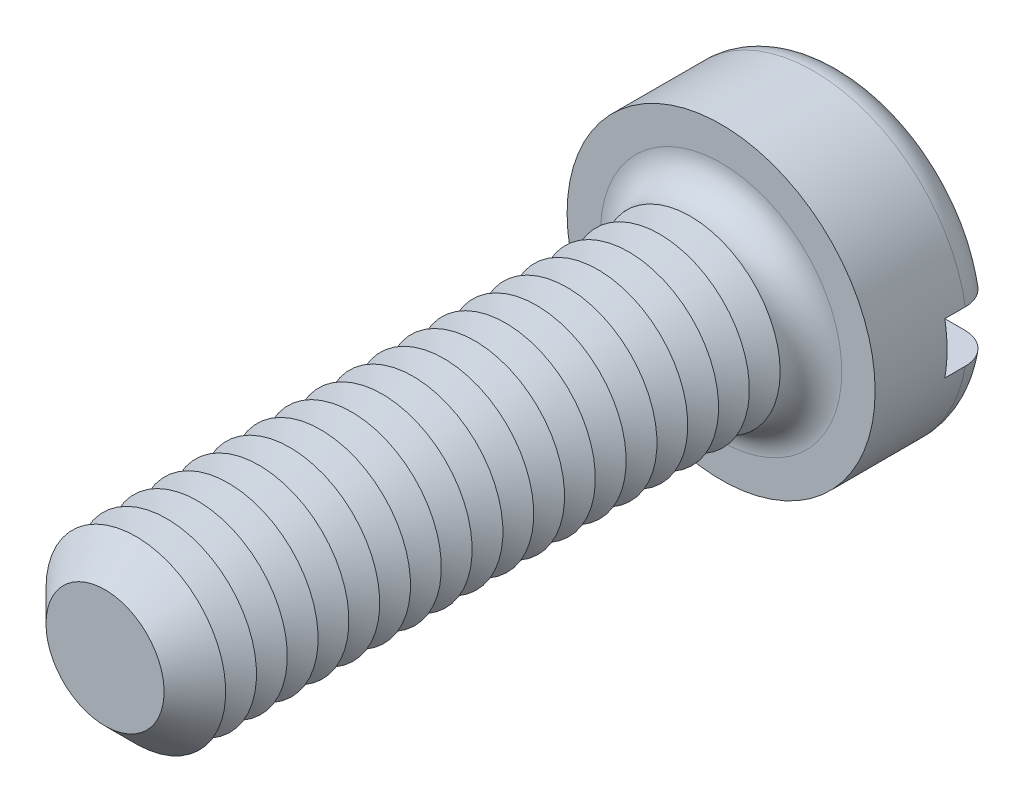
ISO-10303-21;
HEADER;
FILE_DESCRIPTION(('STEP AP214'),'2;1');
FILE_NAME('part.step','',(''),(''),'','','');
FILE_SCHEMA(('AUTOMOTIVE_DESIGN { 1 0 10303 214 1 1 1 1 }'));
ENDSEC;
DATA;
#1=APPLICATION_CONTEXT('core data for automotive mechanical design processes');
#2=APPLICATION_PROTOCOL_DEFINITION('international standard','automotive_design',2000,#1);
#3=PRODUCT_CONTEXT('',#1,'mechanical');
#4=PRODUCT('Part','Part','',(#3));
#5=PRODUCT_RELATED_PRODUCT_CATEGORY('part','',(#4));
#6=PRODUCT_DEFINITION_FORMATION('','',#4);
#7=PRODUCT_DEFINITION_CONTEXT('part definition',#1,'design');
#8=PRODUCT_DEFINITION('design','',#6,#7);
#9=PRODUCT_DEFINITION_SHAPE('','',#8);
#10=(LENGTH_UNIT() NAMED_UNIT(*) SI_UNIT(.MILLI.,.METRE.));
#11=(NAMED_UNIT(*) PLANE_ANGLE_UNIT() SI_UNIT($,.RADIAN.));
#12=(NAMED_UNIT(*) SI_UNIT($,.STERADIAN.) SOLID_ANGLE_UNIT());
#13=UNCERTAINTY_MEASURE_WITH_UNIT(LENGTH_MEASURE(1.E-05),#10,'distance_accuracy_value','');
#14=(GEOMETRIC_REPRESENTATION_CONTEXT(3) GLOBAL_UNCERTAINTY_ASSIGNED_CONTEXT((#13)) GLOBAL_UNIT_ASSIGNED_CONTEXT((#10,
#11,#12)) REPRESENTATION_CONTEXT('',''));
#15=CARTESIAN_POINT('',(0.,0.,0.));
#16=DIRECTION('',(0.,0.,1.));
#17=DIRECTION('',(1.,0.,0.));
#18=AXIS2_PLACEMENT_3D('',#15,#16,#17);
#19=CARTESIAN_POINT('',(0.,0.,-2.4));
#20=DIRECTION('',(0.,0.,1.));
#21=DIRECTION('',(1.,0.,0.));
#22=AXIS2_PLACEMENT_3D('',#19,#20,#21);
#23=PLANE('',#22);
#24=CARTESIAN_POINT('',(0.,0.,-2.4));
#25=DIRECTION('',(0.,0.,1.));
#26=DIRECTION('',(1.,0.,0.));
#27=AXIS2_PLACEMENT_3D('',#24,#25,#26);
#28=CIRCLE('',#27,2.4);
#29=CARTESIAN_POINT('',(-2.3473389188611,0.5,-2.4));
#30=VERTEX_POINT('',#29);
#31=CARTESIAN_POINT('',(2.3473389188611,0.5,-2.4));
#32=VERTEX_POINT('',#31);
#33=EDGE_CURVE('E116',#30,#32,#28,.F.);
#34=ORIENTED_EDGE('',*,*,#33,.T.);
#35=DIRECTION('',(1.,0.,0.));
#36=VECTOR('',#35,1.);
#37=CARTESIAN_POINT('',(-3.,0.5,-2.4));
#38=LINE('',#37,#36);
#39=EDGE_CURVE('E111',#30,#32,#38,.T.);
#40=ORIENTED_EDGE('',*,*,#39,.F.);
#41=EDGE_LOOP('',(#34,#40));
#42=FACE_BOUND('',#41,.T.);
#43=ADVANCED_FACE('F39',(#42),#23,.F.);
#44=CARTESIAN_POINT('',(0.,0.,-1.8));
#45=DIRECTION('',(0.,0.,1.));
#46=DIRECTION('',(1.,0.,0.));
#47=AXIS2_PLACEMENT_3D('',#44,#45,#46);
#48=TOROIDAL_SURFACE('',#47,2.4,0.6);
#49=CARTESIAN_POINT('',(-2.85761641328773,0.5,-2.13010535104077));
#50=CARTESIAN_POINT('',(-2.83871556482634,0.5,-2.1583605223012));
#51=CARTESIAN_POINT('',(-2.81738546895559,0.5,-2.18502342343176));
#52=CARTESIAN_POINT('',(-2.7705148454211,0.5,-2.23439244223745));
#53=CARTESIAN_POINT('',(-2.74496859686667,0.5,-2.25709309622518));
#54=CARTESIAN_POINT('',(-2.6904684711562,0.5,-2.29787524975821));
#55=CARTESIAN_POINT('',(-2.66151863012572,0.5,-2.3159621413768));
#56=CARTESIAN_POINT('',(-2.60103287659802,0.5,-2.34708203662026));
#57=CARTESIAN_POINT('',(-2.56949759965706,0.5,-2.36011627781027));
#58=CARTESIAN_POINT('',(-2.50430694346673,0.5,-2.38095952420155));
#59=CARTESIAN_POINT('',(-2.47062984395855,0.5,-2.38870056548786));
#60=CARTESIAN_POINT('',(-2.40245905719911,0.5,-2.39852415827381));
#61=CARTESIAN_POINT('',(-2.36796525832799,0.5,-2.40060593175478));
#62=CARTESIAN_POINT('',(-2.29850850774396,0.5,-2.39907718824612));
#63=CARTESIAN_POINT('',(-2.2635477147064,0.5,-2.3953679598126));
#64=CARTESIAN_POINT('',(-2.19472542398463,0.5,-2.38219781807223));
#65=CARTESIAN_POINT('',(-2.16086402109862,0.5,-2.37273641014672));
#66=CARTESIAN_POINT('',(-2.09483473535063,0.5,-2.3481926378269));
#67=CARTESIAN_POINT('',(-2.06268841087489,0.5,-2.3330521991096));
#68=CARTESIAN_POINT('',(-2.00140871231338,0.5,-2.29756210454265));
#69=CARTESIAN_POINT('',(-1.97227539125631,0.5,-2.27721235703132));
#70=CARTESIAN_POINT('',(-1.91805676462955,0.5,-2.23196210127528));
#71=CARTESIAN_POINT('',(-1.89294995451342,0.5,-2.20708739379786));
#72=CARTESIAN_POINT('',(-1.84740424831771,0.5,-2.1533758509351));
#73=CARTESIAN_POINT('',(-1.82696468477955,0.5,-2.12453958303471));
#74=CARTESIAN_POINT('',(-1.7919439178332,0.5,-2.06452274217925));
#75=CARTESIAN_POINT('',(-1.7772221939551,0.5,-2.03342424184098));
#76=CARTESIAN_POINT('',(-1.75343025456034,0.5,-1.96913621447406));
#77=CARTESIAN_POINT('',(-1.74435859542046,0.5,-1.93594722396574));
#78=CARTESIAN_POINT('',(-1.73243855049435,0.5,-1.86969199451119));
#79=CARTESIAN_POINT('',(-1.72938008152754,0.5,-1.83666346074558));
#80=CARTESIAN_POINT('',(-1.72896592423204,0.5,-1.77057287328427));
#81=CARTESIAN_POINT('',(-1.73160950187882,0.5,-1.73751082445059));
#82=CARTESIAN_POINT('',(-1.7423966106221,0.5,-1.67291835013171));
#83=CARTESIAN_POINT('',(-1.75043952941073,0.5,-1.64137102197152));
#84=CARTESIAN_POINT('',(-1.77163396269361,0.5,-1.58004446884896));
#85=CARTESIAN_POINT('',(-1.78478577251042,0.5,-1.55026534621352));
#86=CARTESIAN_POINT('',(-1.81598186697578,0.5,-1.49283859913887));
#87=CARTESIAN_POINT('',(-1.83409369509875,0.5,-1.46522772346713));
#88=CARTESIAN_POINT('',(-1.87455179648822,0.5,-1.41330756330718));
#89=CARTESIAN_POINT('',(-1.89689874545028,0.5,-1.38899880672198));
#90=CARTESIAN_POINT('',(-1.94600584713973,0.5,-1.34349499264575));
#91=CARTESIAN_POINT('',(-1.97289034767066,0.5,-1.32243411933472));
#92=CARTESIAN_POINT('',(-2.02972905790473,0.5,-1.28496935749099));
#93=CARTESIAN_POINT('',(-2.05968375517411,0.5,-1.26856621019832));
#94=CARTESIAN_POINT('',(-2.12276894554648,0.5,-1.24040709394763));
#95=CARTESIAN_POINT('',(-2.15596700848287,0.5,-1.22880230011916));
#96=CARTESIAN_POINT('',(-2.22383000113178,0.5,-1.21126311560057));
#97=CARTESIAN_POINT('',(-2.25849504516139,0.5,-1.20532916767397));
#98=CARTESIAN_POINT('',(-2.32870403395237,0.5,-1.1992792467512));
#99=CARTESIAN_POINT('',(-2.36425340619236,0.5,-1.19922586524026));
#100=CARTESIAN_POINT('',(-2.4348506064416,0.5,-1.2051326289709));
#101=CARTESIAN_POINT('',(-2.4698984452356,0.5,-1.21109264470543));
#102=CARTESIAN_POINT('',(-2.53821803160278,0.5,-1.22883658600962));
#103=CARTESIAN_POINT('',(-2.57150081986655,0.5,-1.24057794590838));
#104=CARTESIAN_POINT('',(-2.63557260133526,0.5,-1.2695744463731));
#105=CARTESIAN_POINT('',(-2.66636179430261,0.5,-1.28682914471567));
#106=CARTESIAN_POINT('',(-2.72402406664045,0.5,-1.32606063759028));
#107=CARTESIAN_POINT('',(-2.75095352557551,0.5,-1.34795455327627));
#108=CARTESIAN_POINT('',(-2.80067182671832,0.5,-1.39602603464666));
#109=CARTESIAN_POINT('',(-2.82346106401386,0.5,-1.42220319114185));
#110=CARTESIAN_POINT('',(-2.86383281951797,0.5,-1.47760238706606));
#111=CARTESIAN_POINT('',(-2.88149947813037,0.5,-1.50676312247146));
#112=CARTESIAN_POINT('',(-2.91160874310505,0.5,-1.56766595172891));
#113=CARTESIAN_POINT('',(-2.92405198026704,0.5,-1.59940773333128));
#114=CARTESIAN_POINT('',(-2.94319943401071,0.5,-1.66411282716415));
#115=CARTESIAN_POINT('',(-2.94997843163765,0.5,-1.69705402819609));
#116=CARTESIAN_POINT('',(-2.95787009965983,0.5,-1.7636173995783));
#117=CARTESIAN_POINT('',(-2.95898157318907,0.5,-1.79723971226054));
#118=CARTESIAN_POINT('',(-2.95551354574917,0.5,-1.86397776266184));
#119=CARTESIAN_POINT('',(-2.95096897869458,0.5,-1.89709534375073));
#120=CARTESIAN_POINT('',(-2.93638731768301,0.5,-1.96206785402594));
#121=CARTESIAN_POINT('',(-2.92635713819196,0.5,-1.99392431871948));
#122=CARTESIAN_POINT('',(-2.90618743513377,0.5,-2.04315073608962));
#123=CARTESIAN_POINT('',(-2.89769874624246,0.5,-2.06121519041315));
#124=CARTESIAN_POINT('',(-2.87895753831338,0.5,-2.096404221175));
#125=CARTESIAN_POINT('',(-2.86870503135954,0.5,-2.11352880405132));
#126=CARTESIAN_POINT('',(-2.85761641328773,0.5,-2.13010535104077));
#127=B_SPLINE_CURVE_WITH_KNOTS('',3,(#49,#50,#51,#52,#53,#54,#55,#56,#57,#58,#59,#60,#61,#62,
#63,#64,#65,#66,#67,#68,#69,#70,#71,#72,#73,#74,#75,#76,#77,#78,#79,#80,#81,#82,#83,#84,#85,#86,
#87,#88,#89,#90,#91,#92,#93,#94,#95,#96,#97,#98,#99,#100,#101,#102,#103,#104,#105,#106,#107,
#108,#109,#110,#111,#112,#113,#114,#115,#116,#117,#118,#119,#120,#121,#122,#123,#124,#125,#126),
.UNSPECIFIED.,.T.,.F.,(4,2,2,2,2,2,2,2,2,2,2,2,2,2,2,2,2,2,2,2,2,2,2,2,2,2,2,2,2,2,2,2,2,2,2,2,
2,2,4),(0.,0.101907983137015,0.203955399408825,0.305883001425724,0.407785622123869,
0.510973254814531,0.614175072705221,0.719155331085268,0.824144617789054,0.930238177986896,
1.03633360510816,1.14184204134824,1.24733537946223,1.35004136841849,1.45272110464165,
1.5517448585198,1.65075586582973,1.74797128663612,1.84519232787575,1.9438094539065,
2.0424423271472,2.14443321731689,2.24644032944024,2.35145317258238,2.45647421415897,
2.56261297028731,2.66874944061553,2.77411589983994,2.87947390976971,2.98308820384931,
3.08669260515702,3.18848388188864,3.29026286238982,3.39067588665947,3.49111011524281,
3.59092708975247,3.69061853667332,3.75040561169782,3.81019227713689),.UNSPECIFIED.);
#128=CARTESIAN_POINT('',(-2.95803989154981,0.5,-1.8));
#129=VERTEX_POINT('',#128);
#130=EDGE_CURVE('E323',#129,#30,#127,.T.);
#131=ORIENTED_EDGE('',*,*,#130,.F.);
#132=CARTESIAN_POINT('',(0.,0.,-1.8));
#133=DIRECTION('',(0.,0.,1.));
#134=DIRECTION('',(1.,0.,0.));
#135=AXIS2_PLACEMENT_3D('',#132,#133,#134);
#136=CIRCLE('',#135,3.);
#137=CARTESIAN_POINT('',(2.95803989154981,0.5,-1.8));
#138=VERTEX_POINT('',#137);
#139=EDGE_CURVE('E125',#138,#129,#136,.T.);
#140=ORIENTED_EDGE('',*,*,#139,.F.);
#141=CARTESIAN_POINT('',(1.78664846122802,0.5,-2.05158390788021));
#142=CARTESIAN_POINT('',(1.80142751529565,0.5,-2.08239430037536));
#143=CARTESIAN_POINT('',(1.81889355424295,0.5,-2.111949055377));
#144=CARTESIAN_POINT('',(1.8585933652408,0.5,-2.16770384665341));
#145=CARTESIAN_POINT('',(1.88083491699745,0.5,-2.19389829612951));
#146=CARTESIAN_POINT('',(1.92931942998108,0.5,-2.24217519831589));
#147=CARTESIAN_POINT('',(1.95555471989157,0.5,-2.26426535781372));
#148=CARTESIAN_POINT('',(2.01127789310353,0.5,-2.30384045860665));
#149=CARTESIAN_POINT('',(2.04076488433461,0.5,-2.32132665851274));
#150=CARTESIAN_POINT('',(2.10290022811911,0.5,-2.3516259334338));
#151=CARTESIAN_POINT('',(2.13560600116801,0.5,-2.3643213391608));
#152=CARTESIAN_POINT('',(2.20267136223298,0.5,-2.38412242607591));
#153=CARTESIAN_POINT('',(2.23703118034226,0.5,-2.3912273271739));
#154=CARTESIAN_POINT('',(2.30690186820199,0.5,-2.39969404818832));
#155=CARTESIAN_POINT('',(2.34242185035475,0.5,-2.40098100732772));
#156=CARTESIAN_POINT('',(2.41317063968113,0.5,-2.39753827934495));
#157=CARTESIAN_POINT('',(2.44839945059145,0.5,-2.39280866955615));
#158=CARTESIAN_POINT('',(2.51734146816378,0.5,-2.37746773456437));
#159=CARTESIAN_POINT('',(2.55106223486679,0.5,-2.3668904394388));
#160=CARTESIAN_POINT('',(2.61620389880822,0.5,-2.34013333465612));
#161=CARTESIAN_POINT('',(2.64762498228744,0.5,-2.32395397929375));
#162=CARTESIAN_POINT('',(2.70673284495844,0.5,-2.28672393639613));
#163=CARTESIAN_POINT('',(2.73447138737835,0.5,-2.26575544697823));
#164=CARTESIAN_POINT('',(2.78595339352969,0.5,-2.21938197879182));
#165=CARTESIAN_POINT('',(2.80969724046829,0.5,-2.19397742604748));
#166=CARTESIAN_POINT('',(2.85207235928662,0.5,-2.13993965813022));
#167=CARTESIAN_POINT('',(2.87078674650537,0.5,-2.11137160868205));
#168=CARTESIAN_POINT('',(2.90307455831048,0.5,-2.05146448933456));
#169=CARTESIAN_POINT('',(2.91664841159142,0.5,-2.02012565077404));
#170=CARTESIAN_POINT('',(2.93808283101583,0.5,-1.95603682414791));
#171=CARTESIAN_POINT('',(2.94602016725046,0.5,-1.92331249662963));
#172=CARTESIAN_POINT('',(2.95624273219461,0.5,-1.85699296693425));
#173=CARTESIAN_POINT('',(2.95852824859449,0.5,-1.82339780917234));
#174=CARTESIAN_POINT('',(2.95738171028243,0.5,-1.75655451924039));
#175=CARTESIAN_POINT('',(2.95399174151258,0.5,-1.72330565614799));
#176=CARTESIAN_POINT('',(2.94167749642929,0.5,-1.65784996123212));
#177=CARTESIAN_POINT('',(2.93275329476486,0.5,-1.62564311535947));
#178=CARTESIAN_POINT('',(2.90963870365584,0.5,-1.56317641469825));
#179=CARTESIAN_POINT('',(2.89544787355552,0.5,-1.53291672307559));
#180=CARTESIAN_POINT('',(2.86222325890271,0.5,-1.47518589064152));
#181=CARTESIAN_POINT('',(2.84318935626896,0.5,-1.44771481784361));
#182=CARTESIAN_POINT('',(2.80067851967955,0.5,-1.39611362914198));
#183=CARTESIAN_POINT('',(2.77716960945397,0.5,-1.37200986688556));
#184=CARTESIAN_POINT('',(2.72648704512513,0.5,-1.3280274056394));
#185=CARTESIAN_POINT('',(2.69931317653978,0.5,-1.3081489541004));
#186=CARTESIAN_POINT('',(2.64167967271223,0.5,-1.27288334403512));
#187=CARTESIAN_POINT('',(2.61118015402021,0.5,-1.25756138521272));
#188=CARTESIAN_POINT('',(2.54807315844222,0.5,-1.2321564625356));
#189=CARTESIAN_POINT('',(2.51546550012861,0.5,-1.22207395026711));
#190=CARTESIAN_POINT('',(2.44846246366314,0.5,-1.20724783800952));
#191=CARTESIAN_POINT('',(2.41404584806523,0.5,-1.2026002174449));
#192=CARTESIAN_POINT('',(2.34491756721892,0.5,-1.19904907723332));
#193=CARTESIAN_POINT('',(2.3102058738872,0.5,-1.20014611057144));
#194=CARTESIAN_POINT('',(2.24087507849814,0.5,-1.20808958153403));
#195=CARTESIAN_POINT('',(2.20626660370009,0.5,-1.21502895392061));
#196=CARTESIAN_POINT('',(2.13868705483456,0.5,-1.23457616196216));
#197=CARTESIAN_POINT('',(2.10571611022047,0.5,-1.24718444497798));
#198=CARTESIAN_POINT('',(2.04212010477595,0.5,-1.2778419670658));
#199=CARTESIAN_POINT('',(2.0115131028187,0.5,-1.29592871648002));
#200=CARTESIAN_POINT('',(1.95381117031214,0.5,-1.33703838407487));
#201=CARTESIAN_POINT('',(1.92671618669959,0.5,-1.36006122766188));
#202=CARTESIAN_POINT('',(1.8771749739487,0.5,-1.41014760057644));
#203=CARTESIAN_POINT('',(1.85467966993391,0.5,-1.43716252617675));
#204=CARTESIAN_POINT('',(1.8147167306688,0.5,-1.49468601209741));
#205=CARTESIAN_POINT('',(1.79724791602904,0.5,-1.52519375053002));
#206=CARTESIAN_POINT('',(1.76843420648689,0.5,-1.58782676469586));
#207=CARTESIAN_POINT('',(1.75691546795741,0.5,-1.61987202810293));
#208=CARTESIAN_POINT('',(1.73963101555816,0.5,-1.68548715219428));
#209=CARTESIAN_POINT('',(1.73386545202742,0.5,-1.71905705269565));
#210=CARTESIAN_POINT('',(1.72840927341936,0.5,-1.78556262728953));
#211=CARTESIAN_POINT('',(1.72852416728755,0.5,-1.8184825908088));
#212=CARTESIAN_POINT('',(1.73434422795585,0.5,-1.88379362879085));
#213=CARTESIAN_POINT('',(1.74004181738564,0.5,-1.91618535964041));
#214=CARTESIAN_POINT('',(1.75312909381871,0.5,-1.96568884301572));
#215=CARTESIAN_POINT('',(1.75869685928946,0.5,-1.98330302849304));
#216=CARTESIAN_POINT('',(1.77146455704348,0.5,-2.01792824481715));
#217=CARTESIAN_POINT('',(1.7786644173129,0.5,-2.03493930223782));
#218=CARTESIAN_POINT('',(1.78664846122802,0.5,-2.05158390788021));
#219=B_SPLINE_CURVE_WITH_KNOTS('',3,(#141,#142,#143,#144,#145,#146,#147,#148,#149,#150,#151,
#152,#153,#154,#155,#156,#157,#158,#159,#160,#161,#162,#163,#164,#165,#166,#167,#168,#169,#170,
#171,#172,#173,#174,#175,#176,#177,#178,#179,#180,#181,#182,#183,#184,#185,#186,#187,#188,#189,
#190,#191,#192,#193,#194,#195,#196,#197,#198,#199,#200,#201,#202,#203,#204,#205,#206,#207,#208,
#209,#210,#211,#212,#213,#214,#215,#216,#217,#218),.UNSPECIFIED.,.T.,.F.,(4,2,2,2,2,2,2,2,2,2,2,
2,2,2,2,2,2,2,2,2,2,2,2,2,2,2,2,2,2,2,2,2,2,2,2,2,2,2,4),(0.,0.10244464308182,0.205057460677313,
0.307475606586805,0.409865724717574,0.514628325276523,0.619405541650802,0.72552718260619,
0.831647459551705,0.937156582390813,1.04265715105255,1.1464674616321,1.25026780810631,
1.3522293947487,1.45418247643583,1.55471883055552,1.6552500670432,1.75503912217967,
1.8548268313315,1.95462289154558,2.05442138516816,2.15496174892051,2.25550799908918,
2.35743049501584,2.45936177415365,2.56306719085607,2.66678259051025,2.77217967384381,
2.87758507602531,2.98372914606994,3.08987161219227,3.19481457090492,3.29973288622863,
3.40138228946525,3.50303434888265,3.60132659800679,3.69948562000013,3.75483142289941,
3.8101747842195),.UNSPECIFIED.);
#220=EDGE_CURVE('E325',#32,#138,#219,.T.);
#221=ORIENTED_EDGE('',*,*,#220,.F.);
#222=ORIENTED_EDGE('',*,*,#33,.F.);
#223=EDGE_LOOP('',(#131,#140,#221,#222));
#224=FACE_BOUND('',#223,.T.);
#225=ADVANCED_FACE('F307',(#224),#48,.T.);
#226=CARTESIAN_POINT('',(0.,0.,-2.4));
#227=DIRECTION('',(0.,0.,1.));
#228=DIRECTION('',(1.,0.,0.));
#229=AXIS2_PLACEMENT_3D('',#226,#227,#228);
#230=CYLINDRICAL_SURFACE('',#229,3.);
#231=DIRECTION('',(0.,0.,1.));
#232=VECTOR('',#231,1.);
#233=CARTESIAN_POINT('',(2.95803989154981,0.5,-2.4));
#234=LINE('',#233,#232);
#235=CARTESIAN_POINT('',(2.95803989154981,0.5,-1.4));
#236=VERTEX_POINT('',#235);
#237=EDGE_CURVE('E341',#138,#236,#234,.T.);
#238=ORIENTED_EDGE('',*,*,#237,.F.);
#239=ORIENTED_EDGE('',*,*,#139,.T.);
#240=DIRECTION('',(0.,0.,1.));
#241=VECTOR('',#240,1.);
#242=CARTESIAN_POINT('',(-2.95803989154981,0.5,-2.4));
#243=LINE('',#242,#241);
#244=CARTESIAN_POINT('',(-2.95803989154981,0.5,-1.4));
#245=VERTEX_POINT('',#244);
#246=EDGE_CURVE('E63',#245,#129,#243,.F.);
#247=ORIENTED_EDGE('',*,*,#246,.F.);
#248=CARTESIAN_POINT('',(0.,0.,-1.4));
#249=DIRECTION('',(0.,0.,-1.));
#250=DIRECTION('',(-1.,0.,0.));
#251=AXIS2_PLACEMENT_3D('',#248,#249,#250);
#252=CIRCLE('',#251,3.);
#253=CARTESIAN_POINT('',(-2.95803989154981,-0.5,-1.4));
#254=VERTEX_POINT('',#253);
#255=EDGE_CURVE('E43',#245,#254,#252,.F.);
#256=ORIENTED_EDGE('',*,*,#255,.T.);
#257=DIRECTION('',(0.,0.,1.));
#258=VECTOR('',#257,1.);
#259=CARTESIAN_POINT('',(-2.95803989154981,-0.5,-2.4));
#260=LINE('',#259,#258);
#261=CARTESIAN_POINT('',(-2.9580398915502,-0.5,-1.79999999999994));
#262=VERTEX_POINT('',#261);
#263=EDGE_CURVE('E338',#262,#254,#260,.T.);
#264=ORIENTED_EDGE('',*,*,#263,.F.);
#265=CARTESIAN_POINT('',(2.95803989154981,-0.5,-1.8));
#266=VERTEX_POINT('',#265);
#267=EDGE_CURVE('E127',#262,#266,#136,.T.);
#268=ORIENTED_EDGE('',*,*,#267,.T.);
#269=DIRECTION('',(0.,0.,1.));
#270=VECTOR('',#269,1.);
#271=CARTESIAN_POINT('',(2.95803989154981,-0.5,-2.4));
#272=LINE('',#271,#270);
#273=CARTESIAN_POINT('',(2.95803989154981,-0.5,-1.4));
#274=VERTEX_POINT('',#273);
#275=EDGE_CURVE('E55',#274,#266,#272,.F.);
#276=ORIENTED_EDGE('',*,*,#275,.F.);
#277=EDGE_CURVE('E11',#274,#236,#252,.F.);
#278=ORIENTED_EDGE('',*,*,#277,.T.);
#279=EDGE_LOOP('',(#238,#239,#247,#256,#264,#268,#276,#278));
#280=FACE_BOUND('',#279,.T.);
#281=CARTESIAN_POINT('',(0.,0.,0.));
#282=DIRECTION('',(0.,0.,1.));
#283=DIRECTION('',(1.,0.,0.));
#284=AXIS2_PLACEMENT_3D('',#281,#282,#283);
#285=CIRCLE('',#284,3.);
#286=CARTESIAN_POINT('',(3.,0.,0.));
#287=VERTEX_POINT('',#286);
#288=EDGE_CURVE('E344',#287,#287,#285,.T.);
#289=ORIENTED_EDGE('',*,*,#288,.F.);
#290=EDGE_LOOP('',(#289));
#291=FACE_BOUND('',#290,.T.);
#292=ADVANCED_FACE('F303',(#280,#291),#230,.T.);
#293=CARTESIAN_POINT('',(2.3473389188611,-0.5,-2.4));
#294=VERTEX_POINT('',#293);
#295=CARTESIAN_POINT('',(-2.3473389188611,-0.5,-2.4));
#296=VERTEX_POINT('',#295);
#297=EDGE_CURVE('E109',#294,#296,#28,.F.);
#298=ORIENTED_EDGE('',*,*,#297,.T.);
#299=DIRECTION('',(-1.,0.,0.));
#300=VECTOR('',#299,1.);
#301=CARTESIAN_POINT('',(-3.,-0.5,-2.4));
#302=LINE('',#301,#300);
#303=EDGE_CURVE('E96',#294,#296,#302,.T.);
#304=ORIENTED_EDGE('',*,*,#303,.F.);
#305=EDGE_LOOP('',(#298,#304));
#306=FACE_BOUND('',#305,.T.);
#307=ADVANCED_FACE('F108',(#306),#23,.F.);
#308=CARTESIAN_POINT('',(0.,0.,0.));
#309=DIRECTION('',(0.,0.,1.));
#310=DIRECTION('',(1.,0.,0.));
#311=AXIS2_PLACEMENT_3D('',#308,#309,#310);
#312=PLANE('',#311);
#313=CARTESIAN_POINT('',(0.,0.,0.));
#314=DIRECTION('',(0.,0.,1.));
#315=DIRECTION('',(1.,0.,0.));
#316=AXIS2_PLACEMENT_3D('',#313,#314,#315);
#317=CIRCLE('',#316,2.35);
#318=CARTESIAN_POINT('',(2.35,0.,0.));
#319=VERTEX_POINT('',#318);
#320=EDGE_CURVE('E115',#319,#319,#317,.F.);
#321=ORIENTED_EDGE('',*,*,#320,.T.);
#322=EDGE_LOOP('',(#321));
#323=FACE_BOUND('',#322,.T.);
#324=ORIENTED_EDGE('',*,*,#288,.T.);
#325=EDGE_LOOP('',(#324));
#326=FACE_BOUND('',#325,.T.);
#327=ADVANCED_FACE('F302',(#323,#326),#312,.T.);
#328=CARTESIAN_POINT('',(-2.85761641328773,-0.5,-2.13010535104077));
#329=CARTESIAN_POINT('',(-2.87617085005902,-0.5,-2.10236255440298));
#330=CARTESIAN_POINT('',(-2.89241094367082,-0.5,-2.07304478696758));
#331=CARTESIAN_POINT('',(-2.91975805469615,-0.5,-2.01207835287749));
#332=CARTESIAN_POINT('',(-2.93085958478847,-0.5,-1.98042723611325));
#333=CARTESIAN_POINT('',(-2.94757590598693,-0.5,-1.91570997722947));
#334=CARTESIAN_POINT('',(-2.95319165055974,-0.5,-1.88264408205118));
#335=CARTESIAN_POINT('',(-2.95876526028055,-0.5,-1.81604673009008));
#336=CARTESIAN_POINT('',(-2.95872441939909,-0.5,-1.78251538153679));
#337=CARTESIAN_POINT('',(-2.95300126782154,-0.5,-1.71606888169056));
#338=CARTESIAN_POINT('',(-2.94734076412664,-0.5,-1.68315184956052));
#339=CARTESIAN_POINT('',(-2.93058183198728,-0.5,-1.61873244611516));
#340=CARTESIAN_POINT('',(-2.91948325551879,-0.5,-1.58723011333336));
#341=CARTESIAN_POINT('',(-2.89215903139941,-0.5,-1.52647404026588));
#342=CARTESIAN_POINT('',(-2.87592518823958,-0.5,-1.49722398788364));
#343=CARTESIAN_POINT('',(-2.83881787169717,-0.5,-1.44183365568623));
#344=CARTESIAN_POINT('',(-2.81794425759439,-0.5,-1.41569347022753));
#345=CARTESIAN_POINT('',(-2.77196258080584,-0.5,-1.36700890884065));
#346=CARTESIAN_POINT('',(-2.74681874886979,-0.5,-1.34449832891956));
#347=CARTESIAN_POINT('',(-2.69315595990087,-0.5,-1.30394571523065));
#348=CARTESIAN_POINT('',(-2.66463678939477,-0.5,-1.28590396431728));
#349=CARTESIAN_POINT('',(-2.6045885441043,-0.5,-1.25451133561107));
#350=CARTESIAN_POINT('',(-2.573021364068,-0.5,-1.24123336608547));
#351=CARTESIAN_POINT('',(-2.50813094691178,-0.5,-1.22006271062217));
#352=CARTESIAN_POINT('',(-2.47480755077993,-0.5,-1.21217051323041));
#353=CARTESIAN_POINT('',(-2.40672281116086,-0.5,-1.20185046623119));
#354=CARTESIAN_POINT('',(-2.37194646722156,-0.5,-1.19952155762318));
#355=CARTESIAN_POINT('',(-2.30248663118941,-0.5,-1.20064178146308));
#356=CARTESIAN_POINT('',(-2.26780314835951,-0.5,-1.20409147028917));
#357=CARTESIAN_POINT('',(-2.19896003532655,-0.5,-1.21674803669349));
#358=CARTESIAN_POINT('',(-2.16481620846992,-0.5,-1.22604100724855));
#359=CARTESIAN_POINT('',(-2.09855902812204,-0.5,-1.25020237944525));
#360=CARTESIAN_POINT('',(-2.0664458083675,-0.5,-1.2650711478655));
#361=CARTESIAN_POINT('',(-2.00504979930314,-0.5,-1.3000633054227));
#362=CARTESIAN_POINT('',(-1.97577870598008,-0.5,-1.32020724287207));
#363=CARTESIAN_POINT('',(-1.92109882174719,-0.5,-1.36519538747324));
#364=CARTESIAN_POINT('',(-1.89568984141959,-0.5,-1.39003936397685));
#365=CARTESIAN_POINT('',(-1.84992350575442,-0.5,-1.44333696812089));
#366=CARTESIAN_POINT('',(-1.82949305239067,-0.5,-1.47172774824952));
#367=CARTESIAN_POINT('',(-1.79388305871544,-0.5,-1.53163225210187));
#368=CARTESIAN_POINT('',(-1.77870235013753,-0.5,-1.56314527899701));
#369=CARTESIAN_POINT('',(-1.7545759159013,-0.5,-1.62726698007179));
#370=CARTESIAN_POINT('',(-1.74543784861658,-0.5,-1.65980327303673));
#371=CARTESIAN_POINT('',(-1.73294830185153,-0.5,-1.72596654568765));
#372=CARTESIAN_POINT('',(-1.72959555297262,-0.5,-1.7595932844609));
#373=CARTESIAN_POINT('',(-1.72881879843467,-0.5,-1.82588200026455));
#374=CARTESIAN_POINT('',(-1.73121660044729,-0.5,-1.85854202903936));
#375=CARTESIAN_POINT('',(-1.74148022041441,-0.5,-1.9229888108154));
#376=CARTESIAN_POINT('',(-1.74934586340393,-0.5,-1.95477559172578));
#377=CARTESIAN_POINT('',(-1.77023164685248,-0.5,-2.01650910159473));
#378=CARTESIAN_POINT('',(-1.78323812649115,-0.5,-2.04646046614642));
#379=CARTESIAN_POINT('',(-1.81396733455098,-0.5,-2.10383471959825));
#380=CARTESIAN_POINT('',(-1.83169061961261,-0.5,-2.13125730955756));
#381=CARTESIAN_POINT('',(-1.87183626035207,-0.5,-2.18359240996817));
#382=CARTESIAN_POINT('',(-1.89437158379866,-0.5,-2.20841820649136));
#383=CARTESIAN_POINT('',(-1.9431646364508,-0.5,-2.25409214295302));
#384=CARTESIAN_POINT('',(-1.96942301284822,-0.5,-2.27493958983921));
#385=CARTESIAN_POINT('',(-2.025898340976,-0.5,-2.31281042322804));
#386=CARTESIAN_POINT('',(-2.05622082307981,-0.5,-2.32967654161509));
#387=CARTESIAN_POINT('',(-2.11922391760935,-0.5,-2.35820255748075));
#388=CARTESIAN_POINT('',(-2.15190483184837,-0.5,-2.3698617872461));
#389=CARTESIAN_POINT('',(-2.21944675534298,-0.5,-2.38785911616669));
#390=CARTESIAN_POINT('',(-2.25433929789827,-0.5,-2.39407914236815));
#391=CARTESIAN_POINT('',(-2.32467357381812,-0.5,-2.40058243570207));
#392=CARTESIAN_POINT('',(-2.36011530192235,-0.5,-2.40086575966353));
#393=CARTESIAN_POINT('',(-2.43058129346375,-0.5,-2.39545061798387));
#394=CARTESIAN_POINT('',(-2.46560504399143,-0.5,-2.38974544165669));
#395=CARTESIAN_POINT('',(-2.53418188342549,-0.5,-2.37245602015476));
#396=CARTESIAN_POINT('',(-2.56773468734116,-0.5,-2.36087064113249));
#397=CARTESIAN_POINT('',(-2.63195003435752,-0.5,-2.33229154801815));
#398=CARTESIAN_POINT('',(-2.66264330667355,-0.5,-2.31536681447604));
#399=CARTESIAN_POINT('',(-2.72065333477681,-0.5,-2.2765252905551));
#400=CARTESIAN_POINT('',(-2.7479744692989,-0.5,-2.25461508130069));
#401=CARTESIAN_POINT('',(-2.78903570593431,-0.5,-2.21539504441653));
#402=CARTESIAN_POINT('',(-2.80405150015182,-0.5,-2.19939833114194));
#403=CARTESIAN_POINT('',(-2.83224965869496,-0.5,-2.16586257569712));
#404=CARTESIAN_POINT('',(-2.84543204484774,-0.5,-2.14832355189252));
#405=CARTESIAN_POINT('',(-2.85761641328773,-0.5,-2.13010535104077));
#406=B_SPLINE_CURVE_WITH_KNOTS('',3,(#328,#329,#330,#331,#332,#333,#334,#335,#336,#337,#338,
#339,#340,#341,#342,#343,#344,#345,#346,#347,#348,#349,#350,#351,#352,#353,#354,#355,#356,#357,
#358,#359,#360,#361,#362,#363,#364,#365,#366,#367,#368,#369,#370,#371,#372,#373,#374,#375,#376,
#377,#378,#379,#380,#381,#382,#383,#384,#385,#386,#387,#388,#389,#390,#391,#392,#393,#394,#395,
#396,#397,#398,#399,#400,#401,#402,#403,#404,#405),.UNSPECIFIED.,.T.,.F.,(4,2,2,2,2,2,2,2,2,2,2,
2,2,2,2,2,2,2,2,2,2,2,2,2,2,2,2,2,2,2,2,2,2,2,2,2,2,2,4),(0.,0.100047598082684,
0.200201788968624,0.300338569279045,0.400452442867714,0.500179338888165,0.599908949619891,
0.699798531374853,0.799691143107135,0.900465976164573,1.00124718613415,1.10351091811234,
1.20578392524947,1.30986270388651,1.41395150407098,1.51961105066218,1.62527754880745,
1.73136193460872,1.83744111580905,1.94185359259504,2.04624281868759,2.1471248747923,
2.24798479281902,2.34575994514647,2.44353196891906,2.541045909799,2.63857136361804,
2.73870431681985,2.83885469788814,2.94247024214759,3.0460990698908,3.15192527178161,
3.25775046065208,3.36369436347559,3.46965870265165,3.57430655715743,3.67881706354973,
3.74451732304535,3.81021680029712),.UNSPECIFIED.);
#407=EDGE_CURVE('E103',#296,#262,#406,.T.);
#408=ORIENTED_EDGE('',*,*,#407,.F.);
#409=ORIENTED_EDGE('',*,*,#297,.F.);
#410=CARTESIAN_POINT('',(1.78664846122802,-0.5,-2.05158390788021));
#411=CARTESIAN_POINT('',(1.77253256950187,-0.5,-2.02214917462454));
#412=CARTESIAN_POINT('',(1.76084795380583,-0.5,-1.99152692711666));
#413=CARTESIAN_POINT('',(1.74276267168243,-0.5,-1.92873811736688));
#414=CARTESIAN_POINT('',(1.73636622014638,-0.5,-1.89657034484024));
#415=CARTESIAN_POINT('',(1.72910271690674,-0.5,-1.83160458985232));
#416=CARTESIAN_POINT('',(1.72823699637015,-0.5,-1.79880645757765));
#417=CARTESIAN_POINT('',(1.73207277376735,-0.5,-1.73354460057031));
#418=CARTESIAN_POINT('',(1.7367732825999,-0.5,-1.70108081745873));
#419=CARTESIAN_POINT('',(1.75151033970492,-0.5,-1.63763571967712));
#420=CARTESIAN_POINT('',(1.76150868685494,-0.5,-1.60664550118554));
#421=CARTESIAN_POINT('',(1.78646773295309,-0.5,-1.54673433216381));
#422=CARTESIAN_POINT('',(1.80142897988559,-0.5,-1.51781361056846));
#423=CARTESIAN_POINT('',(1.8361687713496,-0.5,-1.46223275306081));
#424=CARTESIAN_POINT('',(1.85603637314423,-0.5,-1.43562834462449));
#425=CARTESIAN_POINT('',(1.89981598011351,-0.5,-1.38598822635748));
#426=CARTESIAN_POINT('',(1.92372865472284,-0.5,-1.3629531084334));
#427=CARTESIAN_POINT('',(1.97581791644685,-0.5,-1.32025912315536));
#428=CARTESIAN_POINT('',(2.00411431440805,-0.5,-1.30074638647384));
#429=CARTESIAN_POINT('',(2.06351340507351,-0.5,-1.26660223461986));
#430=CARTESIAN_POINT('',(2.09461651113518,-0.5,-1.2519715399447));
#431=CARTESIAN_POINT('',(2.15964055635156,-0.5,-1.22763649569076));
#432=CARTESIAN_POINT('',(2.19361437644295,-0.5,-1.21807321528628));
#433=CARTESIAN_POINT('',(2.26268197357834,-0.5,-1.20474094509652));
#434=CARTESIAN_POINT('',(2.29777581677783,-0.5,-1.20097229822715));
#435=CARTESIAN_POINT('',(2.36834397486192,-0.5,-1.19935270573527));
#436=CARTESIAN_POINT('',(2.40381924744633,-0.5,-1.20154258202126));
#437=CARTESIAN_POINT('',(2.47388621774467,-0.5,-1.211906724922));
#438=CARTESIAN_POINT('',(2.50847794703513,-0.5,-1.22008077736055));
#439=CARTESIAN_POINT('',(2.57542869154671,-0.5,-1.24211740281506));
#440=CARTESIAN_POINT('',(2.60780612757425,-0.5,-1.25592395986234));
#441=CARTESIAN_POINT('',(2.66972487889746,-0.5,-1.28886991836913));
#442=CARTESIAN_POINT('',(2.69926644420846,-0.5,-1.3080088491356));
#443=CARTESIAN_POINT('',(2.75412764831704,-0.5,-1.35072337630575));
#444=CARTESIAN_POINT('',(2.77951140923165,-0.5,-1.37421661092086));
#445=CARTESIAN_POINT('',(2.82588981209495,-0.5,-1.42519687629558));
#446=CARTESIAN_POINT('',(2.84688487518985,-0.5,-1.4526835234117));
#447=CARTESIAN_POINT('',(2.88351678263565,-0.5,-1.51036368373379));
#448=CARTESIAN_POINT('',(2.89923879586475,-0.5,-1.54050312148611));
#449=CARTESIAN_POINT('',(2.92532780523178,-0.5,-1.60301687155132));
#450=CARTESIAN_POINT('',(2.93569520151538,-0.5,-1.63539101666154));
#451=CARTESIAN_POINT('',(2.95066155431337,-0.5,-1.70102985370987));
#452=CARTESIAN_POINT('',(2.95532930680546,-0.5,-1.73427887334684));
#453=CARTESIAN_POINT('',(2.9589838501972,-0.5,-1.80108716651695));
#454=CARTESIAN_POINT('',(2.95797087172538,-0.5,-1.83464642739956));
#455=CARTESIAN_POINT('',(2.9503157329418,-0.5,-1.90093629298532));
#456=CARTESIAN_POINT('',(2.9437032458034,-0.5,-1.93367033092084));
#457=CARTESIAN_POINT('',(2.92508830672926,-0.5,-1.99756717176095));
#458=CARTESIAN_POINT('',(2.91308586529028,-0.5,-2.02872997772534));
#459=CARTESIAN_POINT('',(2.88401713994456,-0.5,-2.08868263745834));
#460=CARTESIAN_POINT('',(2.86693946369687,-0.5,-2.11746696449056));
#461=CARTESIAN_POINT('',(2.82823635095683,-0.5,-2.17179415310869));
#462=CARTESIAN_POINT('',(2.80661076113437,-0.5,-2.19733690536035));
#463=CARTESIAN_POINT('',(2.75921750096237,-0.5,-2.24472182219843));
#464=CARTESIAN_POINT('',(2.73341278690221,-0.5,-2.26652692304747));
#465=CARTESIAN_POINT('',(2.67855512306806,-0.5,-2.30557116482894));
#466=CARTESIAN_POINT('',(2.64950194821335,-0.5,-2.32280998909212));
#467=CARTESIAN_POINT('',(2.58850670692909,-0.5,-2.35251615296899));
#468=CARTESIAN_POINT('',(2.55652763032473,-0.5,-2.36490748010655));
#469=CARTESIAN_POINT('',(2.4909651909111,-0.5,-2.38424946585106));
#470=CARTESIAN_POINT('',(2.45738167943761,-0.5,-2.39119961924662));
#471=CARTESIAN_POINT('',(2.38892891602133,-0.5,-2.39958830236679));
#472=CARTESIAN_POINT('',(2.35404742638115,-0.5,-2.40092701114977));
#473=CARTESIAN_POINT('',(2.28454389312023,-0.5,-2.39781917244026));
#474=CARTESIAN_POINT('',(2.24992186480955,-0.5,-2.39337228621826));
#475=CARTESIAN_POINT('',(2.18139250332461,-0.5,-2.37872879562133));
#476=CARTESIAN_POINT('',(2.14750264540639,-0.5,-2.36845030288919));
#477=CARTESIAN_POINT('',(2.08190943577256,-0.5,-2.34236291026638));
#478=CARTESIAN_POINT('',(2.05020675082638,-0.5,-2.32655233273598));
#479=CARTESIAN_POINT('',(1.98982495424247,-0.5,-2.28976285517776));
#480=CARTESIAN_POINT('',(1.96115527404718,-0.5,-2.26876847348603));
#481=CARTESIAN_POINT('',(1.90785147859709,-0.5,-2.22220002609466));
#482=CARTESIAN_POINT('',(1.88321231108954,-0.5,-2.19663177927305));
#483=CARTESIAN_POINT('',(1.84638483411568,-0.5,-2.15106161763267));
#484=CARTESIAN_POINT('',(1.8328227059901,-0.5,-2.13215328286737));
#485=CARTESIAN_POINT('',(1.80797918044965,-0.5,-2.09289185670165));
#486=CARTESIAN_POINT('',(1.79669771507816,-0.5,-2.07253880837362));
#487=CARTESIAN_POINT('',(1.78664846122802,-0.5,-2.05158390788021));
#488=B_SPLINE_CURVE_WITH_KNOTS('',3,(#410,#411,#412,#413,#414,#415,#416,#417,#418,#419,#420,
#421,#422,#423,#424,#425,#426,#427,#428,#429,#430,#431,#432,#433,#434,#435,#436,#437,#438,#439,
#440,#441,#442,#443,#444,#445,#446,#447,#448,#449,#450,#451,#452,#453,#454,#455,#456,#457,#458,
#459,#460,#461,#462,#463,#464,#465,#466,#467,#468,#469,#470,#471,#472,#473,#474,#475,#476,#477,
#478,#479,#480,#481,#482,#483,#484,#485,#486,#487),.UNSPECIFIED.,.T.,.F.,(4,2,2,2,2,2,2,2,2,2,2,
2,2,2,2,2,2,2,2,2,2,2,2,2,2,2,2,2,2,2,2,2,2,2,2,2,2,2,4),(0.,0.0978512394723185,0.19578039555,
0.293733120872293,0.391668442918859,0.488907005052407,0.58615630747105,0.685320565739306,
0.784501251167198,0.887148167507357,0.989810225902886,1.09519726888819,1.20059054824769,
1.30670769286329,1.41282103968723,1.51790384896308,1.62297738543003,1.72623563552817,
1.82948397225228,1.93097382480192,2.03245609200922,2.13270093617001,2.23294171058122,
2.33265458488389,2.43236726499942,2.53230548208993,2.63224706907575,2.73312861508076,
2.83401715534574,2.93642973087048,3.03885181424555,3.14308833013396,3.24733094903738,
3.35307493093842,3.45885100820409,3.56494689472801,3.67090875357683,3.74057217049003,
3.81023351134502),.UNSPECIFIED.);
#489=EDGE_CURVE('E92',#266,#294,#488,.T.);
#490=ORIENTED_EDGE('',*,*,#489,.F.);
#491=ORIENTED_EDGE('',*,*,#267,.F.);
#492=EDGE_LOOP('',(#408,#409,#490,#491));
#493=FACE_BOUND('',#492,.T.);
#494=ADVANCED_FACE('F113',(#493),#48,.T.);
#495=CARTESIAN_POINT('',(0.,0.,0.6));
#496=DIRECTION('',(0.,0.,1.));
#497=DIRECTION('',(1.,0.,0.));
#498=AXIS2_PLACEMENT_3D('',#495,#496,#497);
#499=TOROIDAL_SURFACE('',#498,2.35,0.6);
#500=ORIENTED_EDGE('',*,*,#320,.F.);
#501=EDGE_LOOP('',(#500));
#502=FACE_BOUND('',#501,.T.);
#503=CARTESIAN_POINT('',(0.,0.,0.6));
#504=DIRECTION('',(0.,0.,-1.));
#505=DIRECTION('',(-1.,0.,0.));
#506=AXIS2_PLACEMENT_3D('',#503,#504,#505);
#507=CIRCLE('',#506,1.75);
#508=CARTESIAN_POINT('',(-1.75,0.,0.6));
#509=VERTEX_POINT('',#508);
#510=EDGE_CURVE('E348',#509,#509,#507,.T.);
#511=ORIENTED_EDGE('',*,*,#510,.T.);
#512=EDGE_LOOP('',(#511));
#513=FACE_BOUND('',#512,.T.);
#514=ADVANCED_FACE('F295',(#502,#513),#499,.F.);
#515=CARTESIAN_POINT('',(0.,0.,0.9));
#516=DIRECTION('',(0.,0.,-1.));
#517=DIRECTION('',(-1.,0.,0.));
#518=AXIS2_PLACEMENT_3D('',#515,#516,#517);
#519=CONICAL_SURFACE('',#518,1.23038475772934,1.0471975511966);
#520=ORIENTED_EDGE('',*,*,#510,.F.);
#521=EDGE_LOOP('',(#520));
#522=FACE_BOUND('',#521,.T.);
#523=CARTESIAN_POINT('',(0.,0.,0.9));
#524=DIRECTION('',(0.,0.,-1.));
#525=DIRECTION('',(-1.,0.,0.));
#526=AXIS2_PLACEMENT_3D('',#523,#524,#525);
#527=CIRCLE('',#526,1.23038475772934);
#528=CARTESIAN_POINT('',(-1.23038475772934,0.,0.9));
#529=VERTEX_POINT('',#528);
#530=EDGE_CURVE('E354',#529,#529,#527,.T.);
#531=ORIENTED_EDGE('',*,*,#530,.T.);
#532=EDGE_LOOP('',(#531));
#533=FACE_BOUND('',#532,.T.);
#534=ADVANCED_FACE('F291',(#522,#533),#519,.T.);
#535=CARTESIAN_POINT('',(0.,0.,1.2));
#536=DIRECTION('',(0.,0.,1.));
#537=DIRECTION('',(1.,0.,0.));
#538=AXIS2_PLACEMENT_3D('',#535,#536,#537);
#539=CONICAL_SURFACE('',#538,1.75,1.0471975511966);
#540=ORIENTED_EDGE('',*,*,#530,.F.);
#541=EDGE_LOOP('',(#540));
#542=FACE_BOUND('',#541,.T.);
#543=CARTESIAN_POINT('',(0.,0.,1.2));
#544=DIRECTION('',(0.,0.,-1.));
#545=DIRECTION('',(-1.,0.,0.));
#546=AXIS2_PLACEMENT_3D('',#543,#544,#545);
#547=CIRCLE('',#546,1.75);
#548=CARTESIAN_POINT('',(-1.75,0.,1.2));
#549=VERTEX_POINT('',#548);
#550=EDGE_CURVE('E359',#549,#549,#547,.T.);
#551=ORIENTED_EDGE('',*,*,#550,.T.);
#552=EDGE_LOOP('',(#551));
#553=FACE_BOUND('',#552,.T.);
#554=ADVANCED_FACE('F287',(#542,#553),#539,.T.);
#555=CARTESIAN_POINT('',(0.,0.,1.5));
#556=DIRECTION('',(0.,0.,-1.));
#557=DIRECTION('',(-1.,0.,0.));
#558=AXIS2_PLACEMENT_3D('',#555,#556,#557);
#559=CONICAL_SURFACE('',#558,1.23038475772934,1.0471975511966);
#560=ORIENTED_EDGE('',*,*,#550,.F.);
#561=EDGE_LOOP('',(#560));
#562=FACE_BOUND('',#561,.T.);
#563=CARTESIAN_POINT('',(0.,0.,1.5));
#564=DIRECTION('',(0.,0.,-1.));
#565=DIRECTION('',(-1.,0.,0.));
#566=AXIS2_PLACEMENT_3D('',#563,#564,#565);
#567=CIRCLE('',#566,1.23038475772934);
#568=CARTESIAN_POINT('',(-1.23038475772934,0.,1.5));
#569=VERTEX_POINT('',#568);
#570=EDGE_CURVE('E363',#569,#569,#567,.T.);
#571=ORIENTED_EDGE('',*,*,#570,.T.);
#572=EDGE_LOOP('',(#571));
#573=FACE_BOUND('',#572,.T.);
#574=ADVANCED_FACE('F283',(#562,#573),#559,.T.);
#575=CARTESIAN_POINT('',(0.,0.,1.8));
#576=DIRECTION('',(0.,0.,1.));
#577=DIRECTION('',(1.,0.,0.));
#578=AXIS2_PLACEMENT_3D('',#575,#576,#577);
#579=CONICAL_SURFACE('',#578,1.75,1.0471975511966);
#580=ORIENTED_EDGE('',*,*,#570,.F.);
#581=EDGE_LOOP('',(#580));
#582=FACE_BOUND('',#581,.T.);
#583=CARTESIAN_POINT('',(0.,0.,1.8));
#584=DIRECTION('',(0.,0.,-1.));
#585=DIRECTION('',(-1.,0.,0.));
#586=AXIS2_PLACEMENT_3D('',#583,#584,#585);
#587=CIRCLE('',#586,1.75);
#588=CARTESIAN_POINT('',(-1.75,0.,1.8));
#589=VERTEX_POINT('',#588);
#590=EDGE_CURVE('E367',#589,#589,#587,.T.);
#591=ORIENTED_EDGE('',*,*,#590,.T.);
#592=EDGE_LOOP('',(#591));
#593=FACE_BOUND('',#592,.T.);
#594=ADVANCED_FACE('F279',(#582,#593),#579,.T.);
#595=CARTESIAN_POINT('',(0.,0.,2.1));
#596=DIRECTION('',(0.,0.,-1.));
#597=DIRECTION('',(-1.,0.,0.));
#598=AXIS2_PLACEMENT_3D('',#595,#596,#597);
#599=CONICAL_SURFACE('',#598,1.23038475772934,1.0471975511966);
#600=ORIENTED_EDGE('',*,*,#590,.F.);
#601=EDGE_LOOP('',(#600));
#602=FACE_BOUND('',#601,.T.);
#603=CARTESIAN_POINT('',(0.,0.,2.1));
#604=DIRECTION('',(0.,0.,-1.));
#605=DIRECTION('',(-1.,0.,0.));
#606=AXIS2_PLACEMENT_3D('',#603,#604,#605);
#607=CIRCLE('',#606,1.23038475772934);
#608=CARTESIAN_POINT('',(-1.23038475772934,0.,2.1));
#609=VERTEX_POINT('',#608);
#610=EDGE_CURVE('E371',#609,#609,#607,.T.);
#611=ORIENTED_EDGE('',*,*,#610,.T.);
#612=EDGE_LOOP('',(#611));
#613=FACE_BOUND('',#612,.T.);
#614=ADVANCED_FACE('F275',(#602,#613),#599,.T.);
#615=CARTESIAN_POINT('',(0.,0.,2.4));
#616=DIRECTION('',(0.,0.,1.));
#617=DIRECTION('',(1.,0.,0.));
#618=AXIS2_PLACEMENT_3D('',#615,#616,#617);
#619=CONICAL_SURFACE('',#618,1.75,1.0471975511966);
#620=ORIENTED_EDGE('',*,*,#610,.F.);
#621=EDGE_LOOP('',(#620));
#622=FACE_BOUND('',#621,.T.);
#623=CARTESIAN_POINT('',(0.,0.,2.4));
#624=DIRECTION('',(0.,0.,-1.));
#625=DIRECTION('',(-1.,0.,0.));
#626=AXIS2_PLACEMENT_3D('',#623,#624,#625);
#627=CIRCLE('',#626,1.75);
#628=CARTESIAN_POINT('',(-1.75,0.,2.4));
#629=VERTEX_POINT('',#628);
#630=EDGE_CURVE('E375',#629,#629,#627,.T.);
#631=ORIENTED_EDGE('',*,*,#630,.T.);
#632=EDGE_LOOP('',(#631));
#633=FACE_BOUND('',#632,.T.);
#634=ADVANCED_FACE('F271',(#622,#633),#619,.T.);
#635=CARTESIAN_POINT('',(0.,0.,2.7));
#636=DIRECTION('',(0.,0.,-1.));
#637=DIRECTION('',(-1.,0.,0.));
#638=AXIS2_PLACEMENT_3D('',#635,#636,#637);
#639=CONICAL_SURFACE('',#638,1.23038475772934,1.0471975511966);
#640=ORIENTED_EDGE('',*,*,#630,.F.);
#641=EDGE_LOOP('',(#640));
#642=FACE_BOUND('',#641,.T.);
#643=CARTESIAN_POINT('',(0.,0.,2.7));
#644=DIRECTION('',(0.,0.,-1.));
#645=DIRECTION('',(-1.,0.,0.));
#646=AXIS2_PLACEMENT_3D('',#643,#644,#645);
#647=CIRCLE('',#646,1.23038475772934);
#648=CARTESIAN_POINT('',(-1.23038475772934,0.,2.7));
#649=VERTEX_POINT('',#648);
#650=EDGE_CURVE('E379',#649,#649,#647,.T.);
#651=ORIENTED_EDGE('',*,*,#650,.T.);
#652=EDGE_LOOP('',(#651));
#653=FACE_BOUND('',#652,.T.);
#654=ADVANCED_FACE('F267',(#642,#653),#639,.T.);
#655=CARTESIAN_POINT('',(0.,0.,3.));
#656=DIRECTION('',(0.,0.,1.));
#657=DIRECTION('',(1.,0.,0.));
#658=AXIS2_PLACEMENT_3D('',#655,#656,#657);
#659=CONICAL_SURFACE('',#658,1.75,1.0471975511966);
#660=ORIENTED_EDGE('',*,*,#650,.F.);
#661=EDGE_LOOP('',(#660));
#662=FACE_BOUND('',#661,.T.);
#663=CARTESIAN_POINT('',(0.,0.,3.));
#664=DIRECTION('',(0.,0.,-1.));
#665=DIRECTION('',(-1.,0.,0.));
#666=AXIS2_PLACEMENT_3D('',#663,#664,#665);
#667=CIRCLE('',#666,1.75);
#668=CARTESIAN_POINT('',(-1.75,0.,3.));
#669=VERTEX_POINT('',#668);
#670=EDGE_CURVE('E383',#669,#669,#667,.T.);
#671=ORIENTED_EDGE('',*,*,#670,.T.);
#672=EDGE_LOOP('',(#671));
#673=FACE_BOUND('',#672,.T.);
#674=ADVANCED_FACE('F263',(#662,#673),#659,.T.);
#675=CARTESIAN_POINT('',(0.,0.,3.3));
#676=DIRECTION('',(0.,0.,-1.));
#677=DIRECTION('',(-1.,0.,0.));
#678=AXIS2_PLACEMENT_3D('',#675,#676,#677);
#679=CONICAL_SURFACE('',#678,1.23038475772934,1.0471975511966);
#680=ORIENTED_EDGE('',*,*,#670,.F.);
#681=EDGE_LOOP('',(#680));
#682=FACE_BOUND('',#681,.T.);
#683=CARTESIAN_POINT('',(0.,0.,3.3));
#684=DIRECTION('',(0.,0.,-1.));
#685=DIRECTION('',(-1.,0.,0.));
#686=AXIS2_PLACEMENT_3D('',#683,#684,#685);
#687=CIRCLE('',#686,1.23038475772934);
#688=CARTESIAN_POINT('',(-1.23038475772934,0.,3.3));
#689=VERTEX_POINT('',#688);
#690=EDGE_CURVE('E387',#689,#689,#687,.T.);
#691=ORIENTED_EDGE('',*,*,#690,.T.);
#692=EDGE_LOOP('',(#691));
#693=FACE_BOUND('',#692,.T.);
#694=ADVANCED_FACE('F259',(#682,#693),#679,.T.);
#695=CARTESIAN_POINT('',(0.,0.,3.6));
#696=DIRECTION('',(0.,0.,1.));
#697=DIRECTION('',(1.,0.,0.));
#698=AXIS2_PLACEMENT_3D('',#695,#696,#697);
#699=CONICAL_SURFACE('',#698,1.75,1.0471975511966);
#700=ORIENTED_EDGE('',*,*,#690,.F.);
#701=EDGE_LOOP('',(#700));
#702=FACE_BOUND('',#701,.T.);
#703=CARTESIAN_POINT('',(0.,0.,3.6));
#704=DIRECTION('',(0.,0.,-1.));
#705=DIRECTION('',(-1.,0.,0.));
#706=AXIS2_PLACEMENT_3D('',#703,#704,#705);
#707=CIRCLE('',#706,1.75);
#708=CARTESIAN_POINT('',(-1.75,0.,3.6));
#709=VERTEX_POINT('',#708);
#710=EDGE_CURVE('E391',#709,#709,#707,.T.);
#711=ORIENTED_EDGE('',*,*,#710,.T.);
#712=EDGE_LOOP('',(#711));
#713=FACE_BOUND('',#712,.T.);
#714=ADVANCED_FACE('F255',(#702,#713),#699,.T.);
#715=CARTESIAN_POINT('',(0.,0.,3.9));
#716=DIRECTION('',(0.,0.,-1.));
#717=DIRECTION('',(-1.,0.,0.));
#718=AXIS2_PLACEMENT_3D('',#715,#716,#717);
#719=CONICAL_SURFACE('',#718,1.23038475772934,1.0471975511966);
#720=ORIENTED_EDGE('',*,*,#710,.F.);
#721=EDGE_LOOP('',(#720));
#722=FACE_BOUND('',#721,.T.);
#723=CARTESIAN_POINT('',(0.,0.,3.9));
#724=DIRECTION('',(0.,0.,-1.));
#725=DIRECTION('',(-1.,0.,0.));
#726=AXIS2_PLACEMENT_3D('',#723,#724,#725);
#727=CIRCLE('',#726,1.23038475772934);
#728=CARTESIAN_POINT('',(-1.23038475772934,0.,3.9));
#729=VERTEX_POINT('',#728);
#730=EDGE_CURVE('E395',#729,#729,#727,.T.);
#731=ORIENTED_EDGE('',*,*,#730,.T.);
#732=EDGE_LOOP('',(#731));
#733=FACE_BOUND('',#732,.T.);
#734=ADVANCED_FACE('F251',(#722,#733),#719,.T.);
#735=CARTESIAN_POINT('',(0.,0.,4.2));
#736=DIRECTION('',(0.,0.,1.));
#737=DIRECTION('',(1.,0.,0.));
#738=AXIS2_PLACEMENT_3D('',#735,#736,#737);
#739=CONICAL_SURFACE('',#738,1.75,1.0471975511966);
#740=ORIENTED_EDGE('',*,*,#730,.F.);
#741=EDGE_LOOP('',(#740));
#742=FACE_BOUND('',#741,.T.);
#743=CARTESIAN_POINT('',(0.,0.,4.2));
#744=DIRECTION('',(0.,0.,-1.));
#745=DIRECTION('',(-1.,0.,0.));
#746=AXIS2_PLACEMENT_3D('',#743,#744,#745);
#747=CIRCLE('',#746,1.75);
#748=CARTESIAN_POINT('',(-1.75,0.,4.2));
#749=VERTEX_POINT('',#748);
#750=EDGE_CURVE('E399',#749,#749,#747,.T.);
#751=ORIENTED_EDGE('',*,*,#750,.T.);
#752=EDGE_LOOP('',(#751));
#753=FACE_BOUND('',#752,.T.);
#754=ADVANCED_FACE('F247',(#742,#753),#739,.T.);
#755=CARTESIAN_POINT('',(0.,0.,4.5));
#756=DIRECTION('',(0.,0.,-1.));
#757=DIRECTION('',(-1.,0.,0.));
#758=AXIS2_PLACEMENT_3D('',#755,#756,#757);
#759=CONICAL_SURFACE('',#758,1.23038475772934,1.0471975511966);
#760=ORIENTED_EDGE('',*,*,#750,.F.);
#761=EDGE_LOOP('',(#760));
#762=FACE_BOUND('',#761,.T.);
#763=CARTESIAN_POINT('',(0.,0.,4.5));
#764=DIRECTION('',(0.,0.,-1.));
#765=DIRECTION('',(-1.,0.,0.));
#766=AXIS2_PLACEMENT_3D('',#763,#764,#765);
#767=CIRCLE('',#766,1.23038475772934);
#768=CARTESIAN_POINT('',(-1.23038475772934,0.,4.5));
#769=VERTEX_POINT('',#768);
#770=EDGE_CURVE('E403',#769,#769,#767,.T.);
#771=ORIENTED_EDGE('',*,*,#770,.T.);
#772=EDGE_LOOP('',(#771));
#773=FACE_BOUND('',#772,.T.);
#774=ADVANCED_FACE('F243',(#762,#773),#759,.T.);
#775=CARTESIAN_POINT('',(0.,0.,4.8));
#776=DIRECTION('',(0.,0.,1.));
#777=DIRECTION('',(1.,0.,0.));
#778=AXIS2_PLACEMENT_3D('',#775,#776,#777);
#779=CONICAL_SURFACE('',#778,1.75,1.0471975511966);
#780=ORIENTED_EDGE('',*,*,#770,.F.);
#781=EDGE_LOOP('',(#780));
#782=FACE_BOUND('',#781,.T.);
#783=CARTESIAN_POINT('',(0.,0.,4.8));
#784=DIRECTION('',(0.,0.,-1.));
#785=DIRECTION('',(-1.,0.,0.));
#786=AXIS2_PLACEMENT_3D('',#783,#784,#785);
#787=CIRCLE('',#786,1.75);
#788=CARTESIAN_POINT('',(-1.75,0.,4.8));
#789=VERTEX_POINT('',#788);
#790=EDGE_CURVE('E407',#789,#789,#787,.T.);
#791=ORIENTED_EDGE('',*,*,#790,.T.);
#792=EDGE_LOOP('',(#791));
#793=FACE_BOUND('',#792,.T.);
#794=ADVANCED_FACE('F239',(#782,#793),#779,.T.);
#795=CARTESIAN_POINT('',(0.,0.,5.1));
#796=DIRECTION('',(0.,0.,-1.));
#797=DIRECTION('',(-1.,0.,0.));
#798=AXIS2_PLACEMENT_3D('',#795,#796,#797);
#799=CONICAL_SURFACE('',#798,1.23038475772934,1.0471975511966);
#800=ORIENTED_EDGE('',*,*,#790,.F.);
#801=EDGE_LOOP('',(#800));
#802=FACE_BOUND('',#801,.T.);
#803=CARTESIAN_POINT('',(0.,0.,5.1));
#804=DIRECTION('',(0.,0.,-1.));
#805=DIRECTION('',(-1.,0.,0.));
#806=AXIS2_PLACEMENT_3D('',#803,#804,#805);
#807=CIRCLE('',#806,1.23038475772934);
#808=CARTESIAN_POINT('',(-1.23038475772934,0.,5.1));
#809=VERTEX_POINT('',#808);
#810=EDGE_CURVE('E411',#809,#809,#807,.T.);
#811=ORIENTED_EDGE('',*,*,#810,.T.);
#812=EDGE_LOOP('',(#811));
#813=FACE_BOUND('',#812,.T.);
#814=ADVANCED_FACE('F235',(#802,#813),#799,.T.);
#815=CARTESIAN_POINT('',(0.,0.,5.4));
#816=DIRECTION('',(0.,0.,1.));
#817=DIRECTION('',(1.,0.,0.));
#818=AXIS2_PLACEMENT_3D('',#815,#816,#817);
#819=CONICAL_SURFACE('',#818,1.75,1.0471975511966);
#820=ORIENTED_EDGE('',*,*,#810,.F.);
#821=EDGE_LOOP('',(#820));
#822=FACE_BOUND('',#821,.T.);
#823=CARTESIAN_POINT('',(0.,0.,5.4));
#824=DIRECTION('',(0.,0.,-1.));
#825=DIRECTION('',(-1.,0.,0.));
#826=AXIS2_PLACEMENT_3D('',#823,#824,#825);
#827=CIRCLE('',#826,1.75);
#828=CARTESIAN_POINT('',(-1.75,0.,5.4));
#829=VERTEX_POINT('',#828);
#830=EDGE_CURVE('E415',#829,#829,#827,.T.);
#831=ORIENTED_EDGE('',*,*,#830,.T.);
#832=EDGE_LOOP('',(#831));
#833=FACE_BOUND('',#832,.T.);
#834=ADVANCED_FACE('F231',(#822,#833),#819,.T.);
#835=CARTESIAN_POINT('',(0.,0.,5.7));
#836=DIRECTION('',(0.,0.,-1.));
#837=DIRECTION('',(-1.,0.,0.));
#838=AXIS2_PLACEMENT_3D('',#835,#836,#837);
#839=CONICAL_SURFACE('',#838,1.23038475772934,1.0471975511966);
#840=ORIENTED_EDGE('',*,*,#830,.F.);
#841=EDGE_LOOP('',(#840));
#842=FACE_BOUND('',#841,.T.);
#843=CARTESIAN_POINT('',(0.,0.,5.7));
#844=DIRECTION('',(0.,0.,-1.));
#845=DIRECTION('',(-1.,0.,0.));
#846=AXIS2_PLACEMENT_3D('',#843,#844,#845);
#847=CIRCLE('',#846,1.23038475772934);
#848=CARTESIAN_POINT('',(-1.23038475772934,0.,5.7));
#849=VERTEX_POINT('',#848);
#850=EDGE_CURVE('E419',#849,#849,#847,.T.);
#851=ORIENTED_EDGE('',*,*,#850,.T.);
#852=EDGE_LOOP('',(#851));
#853=FACE_BOUND('',#852,.T.);
#854=ADVANCED_FACE('F227',(#842,#853),#839,.T.);
#855=CARTESIAN_POINT('',(0.,0.,6.));
#856=DIRECTION('',(0.,0.,1.));
#857=DIRECTION('',(1.,0.,0.));
#858=AXIS2_PLACEMENT_3D('',#855,#856,#857);
#859=CONICAL_SURFACE('',#858,1.75,1.0471975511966);
#860=ORIENTED_EDGE('',*,*,#850,.F.);
#861=EDGE_LOOP('',(#860));
#862=FACE_BOUND('',#861,.T.);
#863=CARTESIAN_POINT('',(0.,0.,6.));
#864=DIRECTION('',(0.,0.,-1.));
#865=DIRECTION('',(-1.,0.,0.));
#866=AXIS2_PLACEMENT_3D('',#863,#864,#865);
#867=CIRCLE('',#866,1.75);
#868=CARTESIAN_POINT('',(-1.75,0.,6.));
#869=VERTEX_POINT('',#868);
#870=EDGE_CURVE('E423',#869,#869,#867,.T.);
#871=ORIENTED_EDGE('',*,*,#870,.T.);
#872=EDGE_LOOP('',(#871));
#873=FACE_BOUND('',#872,.T.);
#874=ADVANCED_FACE('F223',(#862,#873),#859,.T.);
#875=CARTESIAN_POINT('',(0.,0.,6.3));
#876=DIRECTION('',(0.,0.,-1.));
#877=DIRECTION('',(-1.,0.,0.));
#878=AXIS2_PLACEMENT_3D('',#875,#876,#877);
#879=CONICAL_SURFACE('',#878,1.23038475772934,1.0471975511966);
#880=ORIENTED_EDGE('',*,*,#870,.F.);
#881=EDGE_LOOP('',(#880));
#882=FACE_BOUND('',#881,.T.);
#883=CARTESIAN_POINT('',(0.,0.,6.3));
#884=DIRECTION('',(0.,0.,-1.));
#885=DIRECTION('',(-1.,0.,0.));
#886=AXIS2_PLACEMENT_3D('',#883,#884,#885);
#887=CIRCLE('',#886,1.23038475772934);
#888=CARTESIAN_POINT('',(-1.23038475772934,0.,6.3));
#889=VERTEX_POINT('',#888);
#890=EDGE_CURVE('E427',#889,#889,#887,.T.);
#891=ORIENTED_EDGE('',*,*,#890,.T.);
#892=EDGE_LOOP('',(#891));
#893=FACE_BOUND('',#892,.T.);
#894=ADVANCED_FACE('F219',(#882,#893),#879,.T.);
#895=CARTESIAN_POINT('',(0.,0.,6.6));
#896=DIRECTION('',(0.,0.,1.));
#897=DIRECTION('',(1.,0.,0.));
#898=AXIS2_PLACEMENT_3D('',#895,#896,#897);
#899=CONICAL_SURFACE('',#898,1.75,1.0471975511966);
#900=ORIENTED_EDGE('',*,*,#890,.F.);
#901=EDGE_LOOP('',(#900));
#902=FACE_BOUND('',#901,.T.);
#903=CARTESIAN_POINT('',(0.,0.,6.6));
#904=DIRECTION('',(0.,0.,-1.));
#905=DIRECTION('',(-1.,0.,0.));
#906=AXIS2_PLACEMENT_3D('',#903,#904,#905);
#907=CIRCLE('',#906,1.75);
#908=CARTESIAN_POINT('',(-1.75,0.,6.6));
#909=VERTEX_POINT('',#908);
#910=EDGE_CURVE('E431',#909,#909,#907,.T.);
#911=ORIENTED_EDGE('',*,*,#910,.T.);
#912=EDGE_LOOP('',(#911));
#913=FACE_BOUND('',#912,.T.);
#914=ADVANCED_FACE('F215',(#902,#913),#899,.T.);
#915=CARTESIAN_POINT('',(0.,0.,6.9));
#916=DIRECTION('',(0.,0.,-1.));
#917=DIRECTION('',(-1.,0.,0.));
#918=AXIS2_PLACEMENT_3D('',#915,#916,#917);
#919=CONICAL_SURFACE('',#918,1.23038475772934,1.0471975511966);
#920=ORIENTED_EDGE('',*,*,#910,.F.);
#921=EDGE_LOOP('',(#920));
#922=FACE_BOUND('',#921,.T.);
#923=CARTESIAN_POINT('',(0.,0.,6.9));
#924=DIRECTION('',(0.,0.,-1.));
#925=DIRECTION('',(-1.,0.,0.));
#926=AXIS2_PLACEMENT_3D('',#923,#924,#925);
#927=CIRCLE('',#926,1.23038475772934);
#928=CARTESIAN_POINT('',(-1.23038475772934,0.,6.9));
#929=VERTEX_POINT('',#928);
#930=EDGE_CURVE('E434',#929,#929,#927,.T.);
#931=ORIENTED_EDGE('',*,*,#930,.T.);
#932=EDGE_LOOP('',(#931));
#933=FACE_BOUND('',#932,.T.);
#934=ADVANCED_FACE('F211',(#922,#933),#919,.T.);
#935=CARTESIAN_POINT('',(0.,0.,7.2));
#936=DIRECTION('',(0.,0.,1.));
#937=DIRECTION('',(1.,0.,0.));
#938=AXIS2_PLACEMENT_3D('',#935,#936,#937);
#939=CONICAL_SURFACE('',#938,1.75,1.0471975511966);
#940=ORIENTED_EDGE('',*,*,#930,.F.);
#941=EDGE_LOOP('',(#940));
#942=FACE_BOUND('',#941,.T.);
#943=CARTESIAN_POINT('',(0.,0.,7.2));
#944=DIRECTION('',(0.,0.,-1.));
#945=DIRECTION('',(-1.,0.,0.));
#946=AXIS2_PLACEMENT_3D('',#943,#944,#945);
#947=CIRCLE('',#946,1.75);
#948=CARTESIAN_POINT('',(-1.75,0.,7.2));
#949=VERTEX_POINT('',#948);
#950=EDGE_CURVE('E438',#949,#949,#947,.T.);
#951=ORIENTED_EDGE('',*,*,#950,.T.);
#952=EDGE_LOOP('',(#951));
#953=FACE_BOUND('',#952,.T.);
#954=ADVANCED_FACE('F207',(#942,#953),#939,.T.);
#955=CARTESIAN_POINT('',(0.,0.,7.5));
#956=DIRECTION('',(0.,0.,-1.));
#957=DIRECTION('',(-1.,0.,0.));
#958=AXIS2_PLACEMENT_3D('',#955,#956,#957);
#959=CONICAL_SURFACE('',#958,1.23038475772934,1.0471975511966);
#960=ORIENTED_EDGE('',*,*,#950,.F.);
#961=EDGE_LOOP('',(#960));
#962=FACE_BOUND('',#961,.T.);
#963=CARTESIAN_POINT('',(0.,0.,7.5));
#964=DIRECTION('',(0.,0.,-1.));
#965=DIRECTION('',(-1.,0.,0.));
#966=AXIS2_PLACEMENT_3D('',#963,#964,#965);
#967=CIRCLE('',#966,1.23038475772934);
#968=CARTESIAN_POINT('',(-1.23038475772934,0.,7.5));
#969=VERTEX_POINT('',#968);
#970=EDGE_CURVE('E442',#969,#969,#967,.T.);
#971=ORIENTED_EDGE('',*,*,#970,.T.);
#972=EDGE_LOOP('',(#971));
#973=FACE_BOUND('',#972,.T.);
#974=ADVANCED_FACE('F203',(#962,#973),#959,.T.);
#975=CARTESIAN_POINT('',(0.,0.,7.8));
#976=DIRECTION('',(0.,0.,1.));
#977=DIRECTION('',(1.,0.,0.));
#978=AXIS2_PLACEMENT_3D('',#975,#976,#977);
#979=CONICAL_SURFACE('',#978,1.75,1.0471975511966);
#980=ORIENTED_EDGE('',*,*,#970,.F.);
#981=EDGE_LOOP('',(#980));
#982=FACE_BOUND('',#981,.T.);
#983=CARTESIAN_POINT('',(0.,0.,7.8));
#984=DIRECTION('',(0.,0.,-1.));
#985=DIRECTION('',(-1.,0.,0.));
#986=AXIS2_PLACEMENT_3D('',#983,#984,#985);
#987=CIRCLE('',#986,1.75);
#988=CARTESIAN_POINT('',(-1.75,0.,7.8));
#989=VERTEX_POINT('',#988);
#990=EDGE_CURVE('E446',#989,#989,#987,.T.);
#991=ORIENTED_EDGE('',*,*,#990,.T.);
#992=EDGE_LOOP('',(#991));
#993=FACE_BOUND('',#992,.T.);
#994=ADVANCED_FACE('F199',(#982,#993),#979,.T.);
#995=CARTESIAN_POINT('',(0.,0.,8.1));
#996=DIRECTION('',(0.,0.,-1.));
#997=DIRECTION('',(-1.,0.,0.));
#998=AXIS2_PLACEMENT_3D('',#995,#996,#997);
#999=CONICAL_SURFACE('',#998,1.23038475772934,1.0471975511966);
#1000=ORIENTED_EDGE('',*,*,#990,.F.);
#1001=EDGE_LOOP('',(#1000));
#1002=FACE_BOUND('',#1001,.T.);
#1003=CARTESIAN_POINT('',(0.,0.,8.1));
#1004=DIRECTION('',(0.,0.,-1.));
#1005=DIRECTION('',(-1.,0.,0.));
#1006=AXIS2_PLACEMENT_3D('',#1003,#1004,#1005);
#1007=CIRCLE('',#1006,1.23038475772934);
#1008=CARTESIAN_POINT('',(-1.23038475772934,0.,8.1));
#1009=VERTEX_POINT('',#1008);
#1010=EDGE_CURVE('E450',#1009,#1009,#1007,.T.);
#1011=ORIENTED_EDGE('',*,*,#1010,.T.);
#1012=EDGE_LOOP('',(#1011));
#1013=FACE_BOUND('',#1012,.T.);
#1014=ADVANCED_FACE('F195',(#1002,#1013),#999,.T.);
#1015=CARTESIAN_POINT('',(0.,0.,8.4));
#1016=DIRECTION('',(0.,0.,1.));
#1017=DIRECTION('',(1.,0.,0.));
#1018=AXIS2_PLACEMENT_3D('',#1015,#1016,#1017);
#1019=CONICAL_SURFACE('',#1018,1.75,1.0471975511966);
#1020=ORIENTED_EDGE('',*,*,#1010,.F.);
#1021=EDGE_LOOP('',(#1020));
#1022=FACE_BOUND('',#1021,.T.);
#1023=CARTESIAN_POINT('',(0.,0.,8.4));
#1024=DIRECTION('',(0.,0.,-1.));
#1025=DIRECTION('',(-1.,0.,0.));
#1026=AXIS2_PLACEMENT_3D('',#1023,#1024,#1025);
#1027=CIRCLE('',#1026,1.75);
#1028=CARTESIAN_POINT('',(-1.75,0.,8.4));
#1029=VERTEX_POINT('',#1028);
#1030=EDGE_CURVE('E453',#1029,#1029,#1027,.T.);
#1031=ORIENTED_EDGE('',*,*,#1030,.T.);
#1032=EDGE_LOOP('',(#1031));
#1033=FACE_BOUND('',#1032,.T.);
#1034=ADVANCED_FACE('F191',(#1022,#1033),#1019,.T.);
#1035=CARTESIAN_POINT('',(0.,0.,8.7));
#1036=DIRECTION('',(0.,0.,-1.));
#1037=DIRECTION('',(-1.,0.,0.));
#1038=AXIS2_PLACEMENT_3D('',#1035,#1036,#1037);
#1039=CONICAL_SURFACE('',#1038,1.23038475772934,1.0471975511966);
#1040=ORIENTED_EDGE('',*,*,#1030,.F.);
#1041=EDGE_LOOP('',(#1040));
#1042=FACE_BOUND('',#1041,.T.);
#1043=CARTESIAN_POINT('',(0.,0.,8.7));
#1044=DIRECTION('',(0.,0.,-1.));
#1045=DIRECTION('',(-1.,0.,0.));
#1046=AXIS2_PLACEMENT_3D('',#1043,#1044,#1045);
#1047=CIRCLE('',#1046,1.23038475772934);
#1048=CARTESIAN_POINT('',(-1.23038475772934,0.,8.7));
#1049=VERTEX_POINT('',#1048);
#1050=EDGE_CURVE('E456',#1049,#1049,#1047,.T.);
#1051=ORIENTED_EDGE('',*,*,#1050,.T.);
#1052=EDGE_LOOP('',(#1051));
#1053=FACE_BOUND('',#1052,.T.);
#1054=ADVANCED_FACE('F187',(#1042,#1053),#1039,.T.);
#1055=CARTESIAN_POINT('',(0.,0.,9.));
#1056=DIRECTION('',(0.,0.,1.));
#1057=DIRECTION('',(1.,0.,0.));
#1058=AXIS2_PLACEMENT_3D('',#1055,#1056,#1057);
#1059=CONICAL_SURFACE('',#1058,1.75,1.0471975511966);
#1060=ORIENTED_EDGE('',*,*,#1050,.F.);
#1061=EDGE_LOOP('',(#1060));
#1062=FACE_BOUND('',#1061,.T.);
#1063=CARTESIAN_POINT('',(0.,0.,9.));
#1064=DIRECTION('',(0.,0.,-1.));
#1065=DIRECTION('',(-1.,0.,0.));
#1066=AXIS2_PLACEMENT_3D('',#1063,#1064,#1065);
#1067=CIRCLE('',#1066,1.75);
#1068=CARTESIAN_POINT('',(-1.75,0.,9.));
#1069=VERTEX_POINT('',#1068);
#1070=EDGE_CURVE('E460',#1069,#1069,#1067,.T.);
#1071=ORIENTED_EDGE('',*,*,#1070,.T.);
#1072=EDGE_LOOP('',(#1071));
#1073=FACE_BOUND('',#1072,.T.);
#1074=ADVANCED_FACE('F183',(#1062,#1073),#1059,.T.);
#1075=CARTESIAN_POINT('',(0.,0.,9.3));
#1076=DIRECTION('',(0.,0.,-1.));
#1077=DIRECTION('',(-1.,0.,0.));
#1078=AXIS2_PLACEMENT_3D('',#1075,#1076,#1077);
#1079=CONICAL_SURFACE('',#1078,1.23038475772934,1.0471975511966);
#1080=ORIENTED_EDGE('',*,*,#1070,.F.);
#1081=EDGE_LOOP('',(#1080));
#1082=FACE_BOUND('',#1081,.T.);
#1083=CARTESIAN_POINT('',(0.,0.,9.3));
#1084=DIRECTION('',(0.,0.,-1.));
#1085=DIRECTION('',(-1.,0.,0.));
#1086=AXIS2_PLACEMENT_3D('',#1083,#1084,#1085);
#1087=CIRCLE('',#1086,1.23038475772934);
#1088=CARTESIAN_POINT('',(-1.23038475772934,0.,9.3));
#1089=VERTEX_POINT('',#1088);
#1090=EDGE_CURVE('E464',#1089,#1089,#1087,.T.);
#1091=ORIENTED_EDGE('',*,*,#1090,.T.);
#1092=EDGE_LOOP('',(#1091));
#1093=FACE_BOUND('',#1092,.T.);
#1094=ADVANCED_FACE('F179',(#1082,#1093),#1079,.T.);
#1095=CARTESIAN_POINT('',(0.,0.,9.6));
#1096=DIRECTION('',(0.,0.,1.));
#1097=DIRECTION('',(1.,0.,0.));
#1098=AXIS2_PLACEMENT_3D('',#1095,#1096,#1097);
#1099=CONICAL_SURFACE('',#1098,1.75,1.0471975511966);
#1100=ORIENTED_EDGE('',*,*,#1090,.F.);
#1101=EDGE_LOOP('',(#1100));
#1102=FACE_BOUND('',#1101,.T.);
#1103=CARTESIAN_POINT('',(0.,0.,9.6));
#1104=DIRECTION('',(0.,0.,-1.));
#1105=DIRECTION('',(-1.,0.,0.));
#1106=AXIS2_PLACEMENT_3D('',#1103,#1104,#1105);
#1107=CIRCLE('',#1106,1.75);
#1108=CARTESIAN_POINT('',(-1.75,0.,9.6));
#1109=VERTEX_POINT('',#1108);
#1110=EDGE_CURVE('E468',#1109,#1109,#1107,.T.);
#1111=ORIENTED_EDGE('',*,*,#1110,.T.);
#1112=EDGE_LOOP('',(#1111));
#1113=FACE_BOUND('',#1112,.T.);
#1114=ADVANCED_FACE('F175',(#1102,#1113),#1099,.T.);
#1115=CARTESIAN_POINT('',(0.,0.,9.9));
#1116=DIRECTION('',(0.,0.,-1.));
#1117=DIRECTION('',(-1.,0.,0.));
#1118=AXIS2_PLACEMENT_3D('',#1115,#1116,#1117);
#1119=CONICAL_SURFACE('',#1118,1.23038475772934,1.0471975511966);
#1120=ORIENTED_EDGE('',*,*,#1110,.F.);
#1121=EDGE_LOOP('',(#1120));
#1122=FACE_BOUND('',#1121,.T.);
#1123=CARTESIAN_POINT('',(0.,0.,9.9));
#1124=DIRECTION('',(0.,0.,-1.));
#1125=DIRECTION('',(-1.,0.,0.));
#1126=AXIS2_PLACEMENT_3D('',#1123,#1124,#1125);
#1127=CIRCLE('',#1126,1.23038475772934);
#1128=CARTESIAN_POINT('',(-1.23038475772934,0.,9.9));
#1129=VERTEX_POINT('',#1128);
#1130=EDGE_CURVE('E472',#1129,#1129,#1127,.T.);
#1131=ORIENTED_EDGE('',*,*,#1130,.T.);
#1132=EDGE_LOOP('',(#1131));
#1133=FACE_BOUND('',#1132,.T.);
#1134=ADVANCED_FACE('F171',(#1122,#1133),#1119,.T.);
#1135=CARTESIAN_POINT('',(0.,0.,10.2));
#1136=DIRECTION('',(0.,0.,1.));
#1137=DIRECTION('',(1.,0.,0.));
#1138=AXIS2_PLACEMENT_3D('',#1135,#1136,#1137);
#1139=CONICAL_SURFACE('',#1138,1.75,1.0471975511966);
#1140=ORIENTED_EDGE('',*,*,#1130,.F.);
#1141=EDGE_LOOP('',(#1140));
#1142=FACE_BOUND('',#1141,.T.);
#1143=CARTESIAN_POINT('',(0.,0.,10.2));
#1144=DIRECTION('',(0.,0.,-1.));
#1145=DIRECTION('',(-1.,0.,0.));
#1146=AXIS2_PLACEMENT_3D('',#1143,#1144,#1145);
#1147=CIRCLE('',#1146,1.75);
#1148=CARTESIAN_POINT('',(-1.75,0.,10.2));
#1149=VERTEX_POINT('',#1148);
#1150=EDGE_CURVE('E476',#1149,#1149,#1147,.T.);
#1151=ORIENTED_EDGE('',*,*,#1150,.T.);
#1152=EDGE_LOOP('',(#1151));
#1153=FACE_BOUND('',#1152,.T.);
#1154=ADVANCED_FACE('F167',(#1142,#1153),#1139,.T.);
#1155=CARTESIAN_POINT('',(0.,0.,10.5));
#1156=DIRECTION('',(0.,0.,-1.));
#1157=DIRECTION('',(-1.,0.,0.));
#1158=AXIS2_PLACEMENT_3D('',#1155,#1156,#1157);
#1159=CONICAL_SURFACE('',#1158,1.23038475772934,1.0471975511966);
#1160=ORIENTED_EDGE('',*,*,#1150,.F.);
#1161=EDGE_LOOP('',(#1160));
#1162=FACE_BOUND('',#1161,.T.);
#1163=CARTESIAN_POINT('',(0.,0.,10.5));
#1164=DIRECTION('',(0.,0.,-1.));
#1165=DIRECTION('',(-1.,0.,0.));
#1166=AXIS2_PLACEMENT_3D('',#1163,#1164,#1165);
#1167=CIRCLE('',#1166,1.23038475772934);
#1168=CARTESIAN_POINT('',(-1.23038475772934,0.,10.5));
#1169=VERTEX_POINT('',#1168);
#1170=EDGE_CURVE('E480',#1169,#1169,#1167,.T.);
#1171=ORIENTED_EDGE('',*,*,#1170,.T.);
#1172=EDGE_LOOP('',(#1171));
#1173=FACE_BOUND('',#1172,.T.);
#1174=ADVANCED_FACE('F163',(#1162,#1173),#1159,.T.);
#1175=CARTESIAN_POINT('',(0.,0.,10.8));
#1176=DIRECTION('',(0.,0.,1.));
#1177=DIRECTION('',(1.,0.,0.));
#1178=AXIS2_PLACEMENT_3D('',#1175,#1176,#1177);
#1179=CONICAL_SURFACE('',#1178,1.75,1.0471975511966);
#1180=ORIENTED_EDGE('',*,*,#1170,.F.);
#1181=EDGE_LOOP('',(#1180));
#1182=FACE_BOUND('',#1181,.T.);
#1183=CARTESIAN_POINT('',(0.,0.,10.8));
#1184=DIRECTION('',(0.,0.,-1.));
#1185=DIRECTION('',(-1.,0.,0.));
#1186=AXIS2_PLACEMENT_3D('',#1183,#1184,#1185);
#1187=CIRCLE('',#1186,1.75);
#1188=CARTESIAN_POINT('',(-1.75,0.,10.8));
#1189=VERTEX_POINT('',#1188);
#1190=EDGE_CURVE('E484',#1189,#1189,#1187,.T.);
#1191=ORIENTED_EDGE('',*,*,#1190,.T.);
#1192=EDGE_LOOP('',(#1191));
#1193=FACE_BOUND('',#1192,.T.);
#1194=ADVANCED_FACE('F159',(#1182,#1193),#1179,.T.);
#1195=CARTESIAN_POINT('',(0.,0.,11.1));
#1196=DIRECTION('',(0.,0.,-1.));
#1197=DIRECTION('',(-1.,0.,0.));
#1198=AXIS2_PLACEMENT_3D('',#1195,#1196,#1197);
#1199=CONICAL_SURFACE('',#1198,1.23038475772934,1.0471975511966);
#1200=ORIENTED_EDGE('',*,*,#1190,.F.);
#1201=EDGE_LOOP('',(#1200));
#1202=FACE_BOUND('',#1201,.T.);
#1203=CARTESIAN_POINT('',(0.,0.,11.1));
#1204=DIRECTION('',(0.,0.,-1.));
#1205=DIRECTION('',(-1.,0.,0.));
#1206=AXIS2_PLACEMENT_3D('',#1203,#1204,#1205);
#1207=CIRCLE('',#1206,1.23038475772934);
#1208=CARTESIAN_POINT('',(-1.23038475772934,0.,11.1));
#1209=VERTEX_POINT('',#1208);
#1210=EDGE_CURVE('E488',#1209,#1209,#1207,.T.);
#1211=ORIENTED_EDGE('',*,*,#1210,.T.);
#1212=EDGE_LOOP('',(#1211));
#1213=FACE_BOUND('',#1212,.T.);
#1214=ADVANCED_FACE('F155',(#1202,#1213),#1199,.T.);
#1215=CARTESIAN_POINT('',(0.,0.,11.4));
#1216=DIRECTION('',(0.,0.,1.));
#1217=DIRECTION('',(1.,0.,0.));
#1218=AXIS2_PLACEMENT_3D('',#1215,#1216,#1217);
#1219=CONICAL_SURFACE('',#1218,1.75,1.0471975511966);
#1220=ORIENTED_EDGE('',*,*,#1210,.F.);
#1221=EDGE_LOOP('',(#1220));
#1222=FACE_BOUND('',#1221,.T.);
#1223=CARTESIAN_POINT('',(0.,0.,11.4));
#1224=DIRECTION('',(0.,0.,-1.));
#1225=DIRECTION('',(-1.,0.,0.));
#1226=AXIS2_PLACEMENT_3D('',#1223,#1224,#1225);
#1227=CIRCLE('',#1226,1.75);
#1228=CARTESIAN_POINT('',(-1.75,0.,11.4));
#1229=VERTEX_POINT('',#1228);
#1230=EDGE_CURVE('E492',#1229,#1229,#1227,.T.);
#1231=ORIENTED_EDGE('',*,*,#1230,.T.);
#1232=EDGE_LOOP('',(#1231));
#1233=FACE_BOUND('',#1232,.T.);
#1234=ADVANCED_FACE('F150',(#1222,#1233),#1219,.T.);
#1235=CARTESIAN_POINT('',(0.,0.,12.));
#1236=DIRECTION('',(0.,0.,1.));
#1237=DIRECTION('',(1.,0.,0.));
#1238=AXIS2_PLACEMENT_3D('',#1235,#1236,#1237);
#1239=PLANE('',#1238);
#1240=CARTESIAN_POINT('',(0.,0.,12.));
#1241=DIRECTION('',(0.,0.,1.));
#1242=DIRECTION('',(1.,0.,0.));
#1243=AXIS2_PLACEMENT_3D('',#1240,#1241,#1242);
#1244=CIRCLE('',#1243,1.15);
#1245=CARTESIAN_POINT('',(-1.15,0.,12.));
#1246=VERTEX_POINT('',#1245);
#1247=EDGE_CURVE('E104',#1246,#1246,#1244,.T.);
#1248=ORIENTED_EDGE('',*,*,#1247,.T.);
#1249=EDGE_LOOP('',(#1248));
#1250=FACE_BOUND('',#1249,.T.);
#1251=ADVANCED_FACE('F154',(#1250),#1239,.T.);
#1252=CARTESIAN_POINT('',(0.,0.,12.));
#1253=DIRECTION('',(0.,0.,-1.));
#1254=DIRECTION('',(-1.,0.,0.));
#1255=AXIS2_PLACEMENT_3D('',#1252,#1253,#1254);
#1256=CONICAL_SURFACE('',#1255,1.15,0.785398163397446);
#1257=CARTESIAN_POINT('',(-1.75,0.,11.4));
#1258=CARTESIAN_POINT('',(-1.74375,0.,11.40625));
#1259=CARTESIAN_POINT('',(-1.7375,0.,11.4125));
#1260=CARTESIAN_POINT('',(-1.725,0.,11.425));
#1261=CARTESIAN_POINT('',(-1.71875,0.,11.43125));
#1262=CARTESIAN_POINT('',(-1.70625,0.,11.44375));
#1263=CARTESIAN_POINT('',(-1.7,0.,11.45));
#1264=CARTESIAN_POINT('',(-1.6875,0.,11.4625));
#1265=CARTESIAN_POINT('',(-1.68125,0.,11.46875));
#1266=CARTESIAN_POINT('',(-1.66875,0.,11.48125));
#1267=CARTESIAN_POINT('',(-1.6625,0.,11.4875));
#1268=CARTESIAN_POINT('',(-1.65,0.,11.5));
#1269=CARTESIAN_POINT('',(-1.64375,0.,11.50625));
#1270=CARTESIAN_POINT('',(-1.63125,0.,11.51875));
#1271=CARTESIAN_POINT('',(-1.625,0.,11.525));
#1272=CARTESIAN_POINT('',(-1.6125,0.,11.5375));
#1273=CARTESIAN_POINT('',(-1.60625,0.,11.54375));
#1274=CARTESIAN_POINT('',(-1.59375,0.,11.55625));
#1275=CARTESIAN_POINT('',(-1.5875,0.,11.5625));
#1276=CARTESIAN_POINT('',(-1.575,0.,11.575));
#1277=CARTESIAN_POINT('',(-1.56875,0.,11.58125));
#1278=CARTESIAN_POINT('',(-1.55625,0.,11.59375));
#1279=CARTESIAN_POINT('',(-1.55,0.,11.6));
#1280=CARTESIAN_POINT('',(-1.5375,0.,11.6125));
#1281=CARTESIAN_POINT('',(-1.53125,0.,11.61875));
#1282=CARTESIAN_POINT('',(-1.51875,0.,11.63125));
#1283=CARTESIAN_POINT('',(-1.5125,0.,11.6375));
#1284=CARTESIAN_POINT('',(-1.5,0.,11.65));
#1285=CARTESIAN_POINT('',(-1.49375,0.,11.65625));
#1286=CARTESIAN_POINT('',(-1.48125,0.,11.66875));
#1287=CARTESIAN_POINT('',(-1.475,0.,11.675));
#1288=CARTESIAN_POINT('',(-1.4625,0.,11.6875));
#1289=CARTESIAN_POINT('',(-1.45625,0.,11.69375));
#1290=CARTESIAN_POINT('',(-1.44375,0.,11.70625));
#1291=CARTESIAN_POINT('',(-1.4375,0.,11.7125));
#1292=CARTESIAN_POINT('',(-1.425,0.,11.725));
#1293=CARTESIAN_POINT('',(-1.41875,0.,11.73125));
#1294=CARTESIAN_POINT('',(-1.40625,0.,11.74375));
#1295=CARTESIAN_POINT('',(-1.4,0.,11.75));
#1296=CARTESIAN_POINT('',(-1.3875,0.,11.7625));
#1297=CARTESIAN_POINT('',(-1.38125,0.,11.76875));
#1298=CARTESIAN_POINT('',(-1.36875,0.,11.78125));
#1299=CARTESIAN_POINT('',(-1.3625,0.,11.7875));
#1300=CARTESIAN_POINT('',(-1.35,0.,11.8));
#1301=CARTESIAN_POINT('',(-1.34375,0.,11.80625));
#1302=CARTESIAN_POINT('',(-1.33125,0.,11.81875));
#1303=CARTESIAN_POINT('',(-1.325,0.,11.825));
#1304=CARTESIAN_POINT('',(-1.3125,0.,11.8375));
#1305=CARTESIAN_POINT('',(-1.30625,0.,11.84375));
#1306=CARTESIAN_POINT('',(-1.29375,0.,11.85625));
#1307=CARTESIAN_POINT('',(-1.2875,0.,11.8625));
#1308=CARTESIAN_POINT('',(-1.275,0.,11.875));
#1309=CARTESIAN_POINT('',(-1.26875,0.,11.88125));
#1310=CARTESIAN_POINT('',(-1.25625,0.,11.89375));
#1311=CARTESIAN_POINT('',(-1.25,0.,11.9));
#1312=CARTESIAN_POINT('',(-1.2375,0.,11.9125));
#1313=CARTESIAN_POINT('',(-1.23125,0.,11.91875));
#1314=CARTESIAN_POINT('',(-1.21875,0.,11.93125));
#1315=CARTESIAN_POINT('',(-1.2125,0.,11.9375));
#1316=CARTESIAN_POINT('',(-1.2,0.,11.95));
#1317=CARTESIAN_POINT('',(-1.19375,0.,11.95625));
#1318=CARTESIAN_POINT('',(-1.18125,0.,11.96875));
#1319=CARTESIAN_POINT('',(-1.175,0.,11.975));
#1320=CARTESIAN_POINT('',(-1.1625,0.,11.9875));
#1321=CARTESIAN_POINT('',(-1.15625,0.,11.99375));
#1322=CARTESIAN_POINT('',(-1.15,0.,12.));
#1323=B_SPLINE_CURVE_WITH_KNOTS('',3,(#1257,#1258,#1259,#1260,#1261,#1262,#1263,#1264,#1265,
#1266,#1267,#1268,#1269,#1270,#1271,#1272,#1273,#1274,#1275,#1276,#1277,#1278,#1279,#1280,#1281,
#1282,#1283,#1284,#1285,#1286,#1287,#1288,#1289,#1290,#1291,#1292,#1293,#1294,#1295,#1296,#1297,
#1298,#1299,#1300,#1301,#1302,#1303,#1304,#1305,#1306,#1307,#1308,#1309,#1310,#1311,#1312,#1313,
#1314,#1315,#1316,#1317,#1318,#1319,#1320,#1321,#1322),.UNSPECIFIED.,.F.,.F.,(4,2,2,2,2,2,2,2,2,
2,2,2,2,2,2,2,2,2,2,2,2,2,2,2,2,2,2,2,2,2,2,2,4),(0.,0.0265165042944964,0.0530330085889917,
0.0795495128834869,0.106066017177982,0.132582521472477,0.159099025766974,0.185615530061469,
0.212132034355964,0.23864853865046,0.265165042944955,0.291681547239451,0.318198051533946,
0.344714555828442,0.371231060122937,0.397747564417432,0.424264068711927,0.450780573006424,
0.477297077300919,0.503813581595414,0.53033008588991,0.556846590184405,0.583363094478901,
0.609879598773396,0.636396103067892,0.662912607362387,0.689429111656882,0.715945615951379,
0.742462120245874,0.768978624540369,0.795495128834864,0.82201163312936,0.848528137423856),.UNSPECIFIED.);
#1324=EDGE_CURVE('BSEAM41',#1229,#1246,#1323,.T.);
#1325=ORIENTED_EDGE('',*,*,#1230,.F.);
#1326=ORIENTED_EDGE('',*,*,#1247,.F.);
#1327=ORIENTED_EDGE('',*,*,#1324,.T.);
#1328=ORIENTED_EDGE('',*,*,#1324,.F.);
#1329=EDGE_LOOP('',(#1325,#1327,#1326,#1328));
#1330=FACE_BOUND('',#1329,.T.);
#1331=ADVANCED_FACE('F41',(#1330),#1256,.T.);
#1332=CARTESIAN_POINT('',(-3.,0.5,-1.4));
#1333=DIRECTION('',(0.,1.,0.));
#1334=DIRECTION('',(-1.,0.,0.));
#1335=AXIS2_PLACEMENT_3D('',#1332,#1333,#1334);
#1336=PLANE('',#1335);
#1337=ORIENTED_EDGE('',*,*,#246,.T.);
#1338=ORIENTED_EDGE('',*,*,#130,.T.);
#1339=ORIENTED_EDGE('',*,*,#39,.T.);
#1340=ORIENTED_EDGE('',*,*,#220,.T.);
#1341=ORIENTED_EDGE('',*,*,#237,.T.);
#1342=DIRECTION('',(1.,0.,0.));
#1343=VECTOR('',#1342,1.);
#1344=CARTESIAN_POINT('',(-3.,0.5,-1.4));
#1345=LINE('',#1344,#1343);
#1346=EDGE_CURVE('E501',#245,#236,#1345,.T.);
#1347=ORIENTED_EDGE('',*,*,#1346,.F.);
#1348=EDGE_LOOP('',(#1337,#1338,#1339,#1340,#1341,#1347));
#1349=FACE_BOUND('',#1348,.T.);
#1350=ADVANCED_FACE('F147',(#1349),#1336,.F.);
#1351=CARTESIAN_POINT('',(-3.,-0.5,-1.4));
#1352=DIRECTION('',(0.,-1.,0.));
#1353=DIRECTION('',(1.,0.,0.));
#1354=AXIS2_PLACEMENT_3D('',#1351,#1352,#1353);
#1355=PLANE('',#1354);
#1356=ORIENTED_EDGE('',*,*,#263,.T.);
#1357=DIRECTION('',(-1.,0.,0.));
#1358=VECTOR('',#1357,1.);
#1359=CARTESIAN_POINT('',(-3.,-0.5,-1.4));
#1360=LINE('',#1359,#1358);
#1361=EDGE_CURVE('E502',#274,#254,#1360,.T.);
#1362=ORIENTED_EDGE('',*,*,#1361,.F.);
#1363=ORIENTED_EDGE('',*,*,#275,.T.);
#1364=ORIENTED_EDGE('',*,*,#489,.T.);
#1365=ORIENTED_EDGE('',*,*,#303,.T.);
#1366=ORIENTED_EDGE('',*,*,#407,.T.);
#1367=EDGE_LOOP('',(#1356,#1362,#1363,#1364,#1365,#1366));
#1368=FACE_BOUND('',#1367,.T.);
#1369=ADVANCED_FACE('F95',(#1368),#1355,.F.);
#1370=CARTESIAN_POINT('',(0.,0.,-1.4));
#1371=DIRECTION('',(0.,0.,-1.));
#1372=DIRECTION('',(-1.,0.,0.));
#1373=AXIS2_PLACEMENT_3D('',#1370,#1371,#1372);
#1374=PLANE('',#1373);
#1375=ORIENTED_EDGE('',*,*,#1361,.T.);
#1376=ORIENTED_EDGE('',*,*,#255,.F.);
#1377=ORIENTED_EDGE('',*,*,#1346,.T.);
#1378=ORIENTED_EDGE('',*,*,#277,.F.);
#1379=EDGE_LOOP('',(#1375,#1376,#1377,#1378));
#1380=FACE_BOUND('',#1379,.T.);
#1381=ADVANCED_FACE('F146',(#1380),#1374,.T.);
#1382=CLOSED_SHELL('',(#43,#225,#292,#307,#327,#494,#514,#534,#554,#574,#594,#614,#634,#654,
#674,#694,#714,#734,#754,#774,#794,#814,#834,#854,#874,#894,#914,#934,#954,#974,#994,#1014,
#1034,#1054,#1074,#1094,#1114,#1134,#1154,#1174,#1194,#1214,#1234,#1251,#1331,#1350,#1369,#1381));
#1383=MANIFOLD_SOLID_BREP('B2',#1382);
#1384=ADVANCED_BREP_SHAPE_REPRESENTATION('',(#18,#1383),#14);
#1385=SHAPE_DEFINITION_REPRESENTATION(#9,#1384);
ENDSEC;
END-ISO-10303-21;
